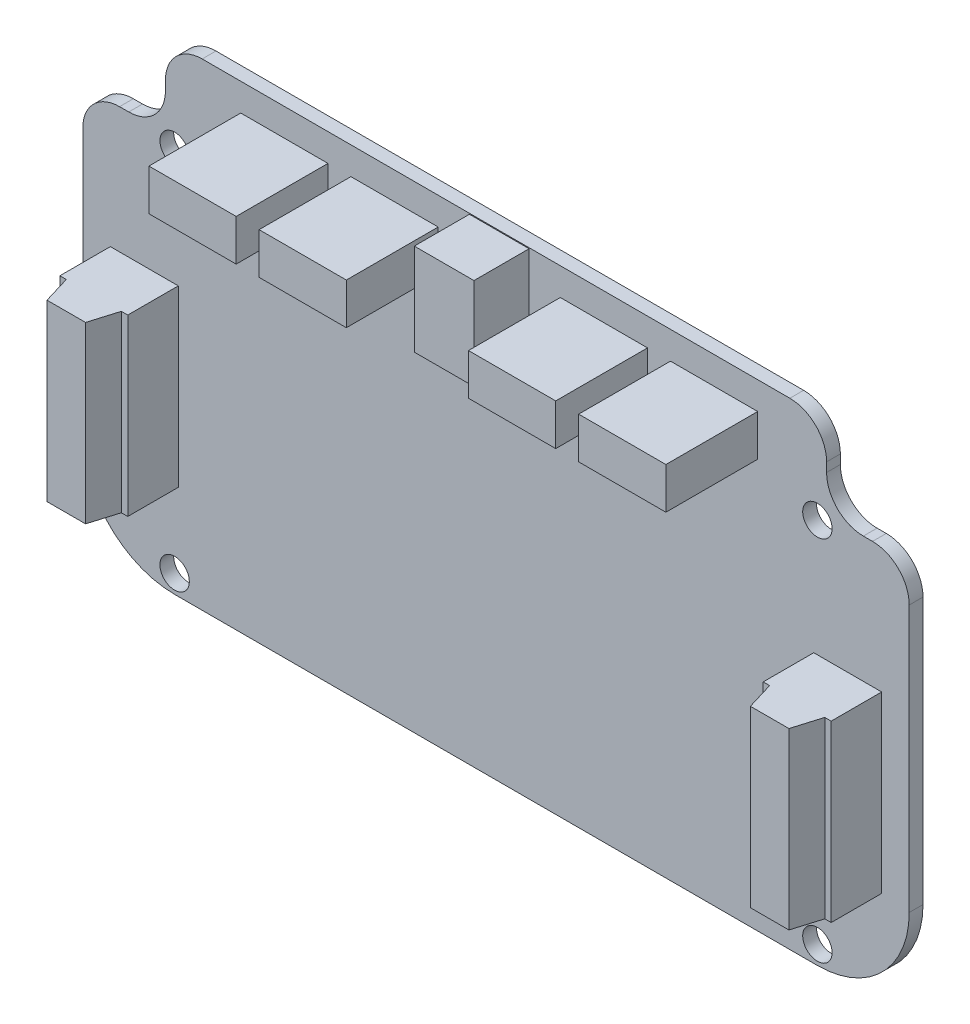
ISO-10303-21;
HEADER;
FILE_DESCRIPTION(('STEP AP214'),'2;1');
FILE_NAME('part.step','',(''),(''),'','','');
FILE_SCHEMA(('AUTOMOTIVE_DESIGN { 1 0 10303 214 1 1 1 1 }'));
ENDSEC;
DATA;
#1=APPLICATION_CONTEXT('core data for automotive mechanical design processes');
#2=APPLICATION_PROTOCOL_DEFINITION('international standard','automotive_design',2000,#1);
#3=PRODUCT_CONTEXT('',#1,'mechanical');
#4=PRODUCT('Part','Part','',(#3));
#5=PRODUCT_RELATED_PRODUCT_CATEGORY('part','',(#4));
#6=PRODUCT_DEFINITION_FORMATION('','',#4);
#7=PRODUCT_DEFINITION_CONTEXT('part definition',#1,'design');
#8=PRODUCT_DEFINITION('design','',#6,#7);
#9=PRODUCT_DEFINITION_SHAPE('','',#8);
#10=(LENGTH_UNIT() NAMED_UNIT(*) SI_UNIT(.MILLI.,.METRE.));
#11=(NAMED_UNIT(*) PLANE_ANGLE_UNIT() SI_UNIT($,.RADIAN.));
#12=(NAMED_UNIT(*) SI_UNIT($,.STERADIAN.) SOLID_ANGLE_UNIT());
#13=UNCERTAINTY_MEASURE_WITH_UNIT(LENGTH_MEASURE(1.E-05),#10,'distance_accuracy_value','');
#14=(GEOMETRIC_REPRESENTATION_CONTEXT(3) GLOBAL_UNCERTAINTY_ASSIGNED_CONTEXT((#13)) GLOBAL_UNIT_ASSIGNED_CONTEXT((#10,
#11,#12)) REPRESENTATION_CONTEXT('',''));
#15=CARTESIAN_POINT('',(0.,0.,0.));
#16=DIRECTION('',(0.,0.,1.));
#17=DIRECTION('',(1.,0.,0.));
#18=AXIS2_PLACEMENT_3D('',#15,#16,#17);
#19=CARTESIAN_POINT('',(-4.,39.,1.5));
#20=DIRECTION('',(0.,0.,1.));
#21=DIRECTION('',(1.,0.,0.));
#22=AXIS2_PLACEMENT_3D('',#19,#20,#21);
#23=PLANE('',#22);
#24=DIRECTION('',(1.,0.,0.));
#25=VECTOR('',#24,1.);
#26=CARTESIAN_POINT('',(-10.4,29.3,1.5));
#27=LINE('',#26,#25);
#28=CARTESIAN_POINT('',(-10.4,29.3,1.5));
#29=VERTEX_POINT('',#28);
#30=CARTESIAN_POINT('',(-3.,29.3,1.5));
#31=VERTEX_POINT('',#30);
#32=EDGE_CURVE('E366',#29,#31,#27,.T.);
#33=ORIENTED_EDGE('',*,*,#32,.T.);
#34=DIRECTION('',(0.,-1.,0.));
#35=VECTOR('',#34,1.);
#36=CARTESIAN_POINT('',(-3.,29.3,1.5));
#37=LINE('',#36,#35);
#38=CARTESIAN_POINT('',(-3.,10.3,1.5));
#39=VERTEX_POINT('',#38);
#40=EDGE_CURVE('E388',#31,#39,#37,.T.);
#41=ORIENTED_EDGE('',*,*,#40,.T.);
#42=DIRECTION('',(1.,0.,0.));
#43=VECTOR('',#42,1.);
#44=CARTESIAN_POINT('',(-10.4,10.3,1.5));
#45=LINE('',#44,#43);
#46=CARTESIAN_POINT('',(-10.4,10.3,1.5));
#47=VERTEX_POINT('',#46);
#48=EDGE_CURVE('E387',#47,#39,#45,.T.);
#49=ORIENTED_EDGE('',*,*,#48,.F.);
#50=DIRECTION('',(0.,-1.,0.));
#51=VECTOR('',#50,1.);
#52=CARTESIAN_POINT('',(-10.4,29.3,1.5));
#53=LINE('',#52,#51);
#54=EDGE_CURVE('E381',#29,#47,#53,.T.);
#55=ORIENTED_EDGE('',*,*,#54,.F.);
#56=EDGE_LOOP('',(#33,#41,#49,#55));
#57=FACE_BOUND('',#56,.T.);
#58=DIRECTION('',(1.,0.,0.));
#59=VECTOR('',#58,1.);
#60=CARTESIAN_POINT('',(-87.,29.3,1.5));
#61=LINE('',#60,#59);
#62=CARTESIAN_POINT('',(-87.,29.3,1.5));
#63=VERTEX_POINT('',#62);
#64=CARTESIAN_POINT('',(-79.6,29.3,1.5));
#65=VERTEX_POINT('',#64);
#66=EDGE_CURVE('E400',#63,#65,#61,.T.);
#67=ORIENTED_EDGE('',*,*,#66,.T.);
#68=DIRECTION('',(0.,-1.,0.));
#69=VECTOR('',#68,1.);
#70=CARTESIAN_POINT('',(-79.6,29.3,1.5));
#71=LINE('',#70,#69);
#72=CARTESIAN_POINT('',(-79.6,10.3,1.5));
#73=VERTEX_POINT('',#72);
#74=EDGE_CURVE('E455',#65,#73,#71,.T.);
#75=ORIENTED_EDGE('',*,*,#74,.T.);
#76=DIRECTION('',(1.,0.,0.));
#77=VECTOR('',#76,1.);
#78=CARTESIAN_POINT('',(-87.,10.3,1.5));
#79=LINE('',#78,#77);
#80=CARTESIAN_POINT('',(-87.,10.3,1.5));
#81=VERTEX_POINT('',#80);
#82=EDGE_CURVE('E424',#81,#73,#79,.T.);
#83=ORIENTED_EDGE('',*,*,#82,.F.);
#84=DIRECTION('',(0.,-1.,0.));
#85=VECTOR('',#84,1.);
#86=CARTESIAN_POINT('',(-87.,29.3,1.5));
#87=LINE('',#86,#85);
#88=EDGE_CURVE('E422',#63,#81,#87,.T.);
#89=ORIENTED_EDGE('',*,*,#88,.F.);
#90=EDGE_LOOP('',(#67,#75,#83,#89));
#91=FACE_BOUND('',#90,.T.);
#92=CARTESIAN_POINT('',(-80.,42.,1.5));
#93=DIRECTION('',(0.,0.,1.));
#94=DIRECTION('',(1.,0.,0.));
#95=AXIS2_PLACEMENT_3D('',#92,#93,#94);
#96=CIRCLE('',#95,1.59999999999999);
#97=CARTESIAN_POINT('',(-78.4,42.,1.5));
#98=VERTEX_POINT('',#97);
#99=EDGE_CURVE('E603',#98,#98,#96,.T.);
#100=ORIENTED_EDGE('',*,*,#99,.F.);
#101=EDGE_LOOP('',(#100));
#102=FACE_BOUND('',#101,.T.);
#103=CARTESIAN_POINT('',(-9.99999999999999,42.,1.5));
#104=DIRECTION('',(0.,0.,1.));
#105=DIRECTION('',(1.,0.,0.));
#106=AXIS2_PLACEMENT_3D('',#103,#104,#105);
#107=CIRCLE('',#106,1.59999999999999);
#108=CARTESIAN_POINT('',(-8.40000000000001,42.,1.5));
#109=VERTEX_POINT('',#108);
#110=EDGE_CURVE('E609',#109,#109,#107,.T.);
#111=ORIENTED_EDGE('',*,*,#110,.F.);
#112=EDGE_LOOP('',(#111));
#113=FACE_BOUND('',#112,.T.);
#114=CARTESIAN_POINT('',(-9.99999999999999,1.99999999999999,1.5));
#115=DIRECTION('',(0.,0.,1.));
#116=DIRECTION('',(1.,0.,0.));
#117=AXIS2_PLACEMENT_3D('',#114,#115,#116);
#118=CIRCLE('',#117,1.59999999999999);
#119=CARTESIAN_POINT('',(-8.40000000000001,1.99999999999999,1.5));
#120=VERTEX_POINT('',#119);
#121=EDGE_CURVE('E615',#120,#120,#118,.T.);
#122=ORIENTED_EDGE('',*,*,#121,.F.);
#123=EDGE_LOOP('',(#122));
#124=FACE_BOUND('',#123,.T.);
#125=CARTESIAN_POINT('',(-80.,1.99999999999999,1.5));
#126=DIRECTION('',(0.,0.,1.));
#127=DIRECTION('',(1.,0.,0.));
#128=AXIS2_PLACEMENT_3D('',#125,#126,#127);
#129=CIRCLE('',#128,1.59999999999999);
#130=CARTESIAN_POINT('',(-78.4,1.99999999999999,1.5));
#131=VERTEX_POINT('',#130);
#132=EDGE_CURVE('E621',#131,#131,#129,.T.);
#133=ORIENTED_EDGE('',*,*,#132,.F.);
#134=EDGE_LOOP('',(#133));
#135=FACE_BOUND('',#134,.T.);
#136=CARTESIAN_POINT('',(-4.,39.,1.5));
#137=DIRECTION('',(0.,0.,1.));
#138=DIRECTION('',(1.,0.,0.));
#139=AXIS2_PLACEMENT_3D('',#136,#137,#138);
#140=CIRCLE('',#139,4.);
#141=CARTESIAN_POINT('',(0.,39.,1.5));
#142=VERTEX_POINT('',#141);
#143=CARTESIAN_POINT('',(-4.00000000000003,43.,1.5));
#144=VERTEX_POINT('',#143);
#145=EDGE_CURVE('E628',#142,#144,#140,.T.);
#146=ORIENTED_EDGE('',*,*,#145,.T.);
#147=DIRECTION('',(-1.,0.,0.));
#148=VECTOR('',#147,1.);
#149=CARTESIAN_POINT('',(-4.99999999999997,43.,1.5));
#150=LINE('',#149,#148);
#151=CARTESIAN_POINT('',(-4.99999999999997,43.,1.5));
#152=VERTEX_POINT('',#151);
#153=EDGE_CURVE('E631',#144,#152,#150,.T.);
#154=ORIENTED_EDGE('',*,*,#153,.T.);
#155=CARTESIAN_POINT('',(-5.,47.,1.5));
#156=DIRECTION('',(0.,0.,-1.));
#157=DIRECTION('',(-1.,0.,0.));
#158=AXIS2_PLACEMENT_3D('',#155,#156,#157);
#159=CIRCLE('',#158,4.);
#160=CARTESIAN_POINT('',(-9.,47.,1.5));
#161=VERTEX_POINT('',#160);
#162=EDGE_CURVE('E634',#152,#161,#159,.T.);
#163=ORIENTED_EDGE('',*,*,#162,.T.);
#164=DIRECTION('',(0.,1.,0.));
#165=VECTOR('',#164,1.);
#166=CARTESIAN_POINT('',(-9.,48.,1.5));
#167=LINE('',#166,#165);
#168=CARTESIAN_POINT('',(-9.,48.,1.5));
#169=VERTEX_POINT('',#168);
#170=EDGE_CURVE('E636',#161,#169,#167,.T.);
#171=ORIENTED_EDGE('',*,*,#170,.T.);
#172=CARTESIAN_POINT('',(-13.,48.,1.5));
#173=DIRECTION('',(0.,0.,1.));
#174=DIRECTION('',(1.,0.,0.));
#175=AXIS2_PLACEMENT_3D('',#172,#173,#174);
#176=CIRCLE('',#175,4.);
#177=CARTESIAN_POINT('',(-13.,52.,1.5));
#178=VERTEX_POINT('',#177);
#179=EDGE_CURVE('E638',#169,#178,#176,.T.);
#180=ORIENTED_EDGE('',*,*,#179,.T.);
#181=DIRECTION('',(-1.,0.,0.));
#182=VECTOR('',#181,1.);
#183=CARTESIAN_POINT('',(-13.,52.,1.5));
#184=LINE('',#183,#182);
#185=CARTESIAN_POINT('',(-77.,52.,1.5));
#186=VERTEX_POINT('',#185);
#187=EDGE_CURVE('E640',#178,#186,#184,.T.);
#188=ORIENTED_EDGE('',*,*,#187,.T.);
#189=CARTESIAN_POINT('',(-77.,48.,1.5));
#190=DIRECTION('',(0.,0.,1.));
#191=DIRECTION('',(1.,0.,0.));
#192=AXIS2_PLACEMENT_3D('',#189,#190,#191);
#193=CIRCLE('',#192,4.);
#194=CARTESIAN_POINT('',(-81.,48.,1.5));
#195=VERTEX_POINT('',#194);
#196=EDGE_CURVE('E642',#186,#195,#193,.T.);
#197=ORIENTED_EDGE('',*,*,#196,.T.);
#198=DIRECTION('',(0.,-1.,0.));
#199=VECTOR('',#198,1.);
#200=CARTESIAN_POINT('',(-81.,48.,1.5));
#201=LINE('',#200,#199);
#202=CARTESIAN_POINT('',(-81.,47.,1.5));
#203=VERTEX_POINT('',#202);
#204=EDGE_CURVE('E644',#195,#203,#201,.T.);
#205=ORIENTED_EDGE('',*,*,#204,.T.);
#206=CARTESIAN_POINT('',(-85.,47.,1.5));
#207=DIRECTION('',(0.,0.,-1.));
#208=DIRECTION('',(-1.,0.,0.));
#209=AXIS2_PLACEMENT_3D('',#206,#207,#208);
#210=CIRCLE('',#209,4.);
#211=CARTESIAN_POINT('',(-85.,43.,1.5));
#212=VERTEX_POINT('',#211);
#213=EDGE_CURVE('E646',#203,#212,#210,.T.);
#214=ORIENTED_EDGE('',*,*,#213,.T.);
#215=DIRECTION('',(-1.,0.,0.));
#216=VECTOR('',#215,1.);
#217=CARTESIAN_POINT('',(-85.,43.,1.5));
#218=LINE('',#217,#216);
#219=CARTESIAN_POINT('',(-86.,43.,1.5));
#220=VERTEX_POINT('',#219);
#221=EDGE_CURVE('E648',#212,#220,#218,.T.);
#222=ORIENTED_EDGE('',*,*,#221,.T.);
#223=CARTESIAN_POINT('',(-86.,39.,1.5));
#224=DIRECTION('',(0.,0.,1.));
#225=DIRECTION('',(1.,0.,0.));
#226=AXIS2_PLACEMENT_3D('',#223,#224,#225);
#227=CIRCLE('',#226,4.);
#228=CARTESIAN_POINT('',(-90.,39.,1.5));
#229=VERTEX_POINT('',#228);
#230=EDGE_CURVE('E650',#220,#229,#227,.T.);
#231=ORIENTED_EDGE('',*,*,#230,.T.);
#232=DIRECTION('',(0.,-1.,0.));
#233=VECTOR('',#232,1.);
#234=CARTESIAN_POINT('',(-90.,10.0000000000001,1.5));
#235=LINE('',#234,#233);
#236=CARTESIAN_POINT('',(-90.,10.0000000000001,1.5));
#237=VERTEX_POINT('',#236);
#238=EDGE_CURVE('E652',#229,#237,#235,.T.);
#239=ORIENTED_EDGE('',*,*,#238,.T.);
#240=CARTESIAN_POINT('',(-80.,9.99999999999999,1.5));
#241=DIRECTION('',(0.,0.,1.));
#242=DIRECTION('',(-1.,0.,0.));
#243=AXIS2_PLACEMENT_3D('',#240,#241,#242);
#244=CIRCLE('',#243,10.);
#245=CARTESIAN_POINT('',(-79.9999999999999,0.,1.5));
#246=VERTEX_POINT('',#245);
#247=EDGE_CURVE('E654',#237,#246,#244,.T.);
#248=ORIENTED_EDGE('',*,*,#247,.T.);
#249=DIRECTION('',(1.,0.,0.));
#250=VECTOR('',#249,1.);
#251=CARTESIAN_POINT('',(-10.0000000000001,0.,1.5));
#252=LINE('',#251,#250);
#253=CARTESIAN_POINT('',(-10.0000000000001,0.,1.5));
#254=VERTEX_POINT('',#253);
#255=EDGE_CURVE('E656',#246,#254,#252,.T.);
#256=ORIENTED_EDGE('',*,*,#255,.T.);
#257=CARTESIAN_POINT('',(-10.,10.,1.5));
#258=DIRECTION('',(0.,0.,1.));
#259=DIRECTION('',(1.,0.,0.));
#260=AXIS2_PLACEMENT_3D('',#257,#258,#259);
#261=CIRCLE('',#260,10.);
#262=CARTESIAN_POINT('',(0.,10.0000000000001,1.5));
#263=VERTEX_POINT('',#262);
#264=EDGE_CURVE('E658',#254,#263,#261,.T.);
#265=ORIENTED_EDGE('',*,*,#264,.T.);
#266=DIRECTION('',(0.,1.,0.));
#267=VECTOR('',#266,1.);
#268=CARTESIAN_POINT('',(0.,10.0000000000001,1.5));
#269=LINE('',#268,#267);
#270=EDGE_CURVE('E660',#263,#142,#269,.T.);
#271=ORIENTED_EDGE('',*,*,#270,.T.);
#272=EDGE_LOOP('',(#146,#154,#163,#171,#180,#188,#197,#205,#214,#222,#231,#239,#248,#256,#265,#271));
#273=FACE_BOUND('',#272,.T.);
#274=DIRECTION('',(1.,0.,0.));
#275=VECTOR('',#274,1.);
#276=CARTESIAN_POINT('',(-72.8,44.5,1.5));
#277=LINE('',#276,#275);
#278=CARTESIAN_POINT('',(-72.8,44.5,1.5));
#279=VERTEX_POINT('',#278);
#280=CARTESIAN_POINT('',(-63.3,44.5,1.5));
#281=VERTEX_POINT('',#280);
#282=EDGE_CURVE('E588',#279,#281,#277,.T.);
#283=ORIENTED_EDGE('',*,*,#282,.F.);
#284=DIRECTION('',(0.,-1.,0.));
#285=VECTOR('',#284,1.);
#286=CARTESIAN_POINT('',(-72.8,49.,1.5));
#287=LINE('',#286,#285);
#288=CARTESIAN_POINT('',(-72.8,49.,1.5));
#289=VERTEX_POINT('',#288);
#290=EDGE_CURVE('E574',#289,#279,#287,.T.);
#291=ORIENTED_EDGE('',*,*,#290,.F.);
#292=DIRECTION('',(-1.,0.,0.));
#293=VECTOR('',#292,1.);
#294=CARTESIAN_POINT('',(-72.8,49.,1.5));
#295=LINE('',#294,#293);
#296=CARTESIAN_POINT('',(-63.3,49.,1.5));
#297=VERTEX_POINT('',#296);
#298=EDGE_CURVE('E579',#297,#289,#295,.T.);
#299=ORIENTED_EDGE('',*,*,#298,.F.);
#300=DIRECTION('',(0.,1.,0.));
#301=VECTOR('',#300,1.);
#302=CARTESIAN_POINT('',(-63.3,49.,1.5));
#303=LINE('',#302,#301);
#304=EDGE_CURVE('E590',#281,#297,#303,.T.);
#305=ORIENTED_EDGE('',*,*,#304,.F.);
#306=EDGE_LOOP('',(#283,#291,#299,#305));
#307=FACE_BOUND('',#306,.T.);
#308=DIRECTION('',(0.,1.,0.));
#309=VECTOR('',#308,1.);
#310=CARTESIAN_POINT('',(-16.5,49.,1.5));
#311=LINE('',#310,#309);
#312=CARTESIAN_POINT('',(-16.5,44.5,1.5));
#313=VERTEX_POINT('',#312);
#314=CARTESIAN_POINT('',(-16.5,49.,1.5));
#315=VERTEX_POINT('',#314);
#316=EDGE_CURVE('E559',#313,#315,#311,.T.);
#317=ORIENTED_EDGE('',*,*,#316,.F.);
#318=DIRECTION('',(1.,0.,0.));
#319=VECTOR('',#318,1.);
#320=CARTESIAN_POINT('',(-26.,44.5,1.5));
#321=LINE('',#320,#319);
#322=CARTESIAN_POINT('',(-26.,44.5,1.5));
#323=VERTEX_POINT('',#322);
#324=EDGE_CURVE('E545',#323,#313,#321,.T.);
#325=ORIENTED_EDGE('',*,*,#324,.F.);
#326=DIRECTION('',(0.,-1.,0.));
#327=VECTOR('',#326,1.);
#328=CARTESIAN_POINT('',(-26.,49.,1.5));
#329=LINE('',#328,#327);
#330=CARTESIAN_POINT('',(-26.,49.,1.5));
#331=VERTEX_POINT('',#330);
#332=EDGE_CURVE('E550',#331,#323,#329,.T.);
#333=ORIENTED_EDGE('',*,*,#332,.F.);
#334=DIRECTION('',(-1.,0.,0.));
#335=VECTOR('',#334,1.);
#336=CARTESIAN_POINT('',(-26.,49.,1.5));
#337=LINE('',#336,#335);
#338=EDGE_CURVE('E561',#315,#331,#337,.T.);
#339=ORIENTED_EDGE('',*,*,#338,.F.);
#340=EDGE_LOOP('',(#317,#325,#333,#339));
#341=FACE_BOUND('',#340,.T.);
#342=DIRECTION('',(0.,-1.,0.));
#343=VECTOR('',#342,1.);
#344=CARTESIAN_POINT('',(-60.8,49.,1.5));
#345=LINE('',#344,#343);
#346=CARTESIAN_POINT('',(-60.8,49.,1.5));
#347=VERTEX_POINT('',#346);
#348=CARTESIAN_POINT('',(-60.8,44.5,1.5));
#349=VERTEX_POINT('',#348);
#350=EDGE_CURVE('E530',#347,#349,#345,.T.);
#351=ORIENTED_EDGE('',*,*,#350,.F.);
#352=DIRECTION('',(-1.,0.,0.));
#353=VECTOR('',#352,1.);
#354=CARTESIAN_POINT('',(-60.8,49.,1.5));
#355=LINE('',#354,#353);
#356=CARTESIAN_POINT('',(-51.3,49.,1.5));
#357=VERTEX_POINT('',#356);
#358=EDGE_CURVE('E516',#357,#347,#355,.T.);
#359=ORIENTED_EDGE('',*,*,#358,.F.);
#360=DIRECTION('',(0.,1.,0.));
#361=VECTOR('',#360,1.);
#362=CARTESIAN_POINT('',(-51.3,49.,1.5));
#363=LINE('',#362,#361);
#364=CARTESIAN_POINT('',(-51.3,44.5,1.5));
#365=VERTEX_POINT('',#364);
#366=EDGE_CURVE('E521',#365,#357,#363,.T.);
#367=ORIENTED_EDGE('',*,*,#366,.F.);
#368=DIRECTION('',(1.,0.,0.));
#369=VECTOR('',#368,1.);
#370=CARTESIAN_POINT('',(-60.8,44.5,1.5));
#371=LINE('',#370,#369);
#372=EDGE_CURVE('E532',#349,#365,#371,.T.);
#373=ORIENTED_EDGE('',*,*,#372,.F.);
#374=EDGE_LOOP('',(#351,#359,#367,#373));
#375=FACE_BOUND('',#374,.T.);
#376=DIRECTION('',(0.,-1.,0.));
#377=VECTOR('',#376,1.);
#378=CARTESIAN_POINT('',(-38.,49.,1.5));
#379=LINE('',#378,#377);
#380=CARTESIAN_POINT('',(-38.,49.,1.5));
#381=VERTEX_POINT('',#380);
#382=CARTESIAN_POINT('',(-38.,44.5,1.5));
#383=VERTEX_POINT('',#382);
#384=EDGE_CURVE('E501',#381,#383,#379,.T.);
#385=ORIENTED_EDGE('',*,*,#384,.F.);
#386=DIRECTION('',(-1.,0.,0.));
#387=VECTOR('',#386,1.);
#388=CARTESIAN_POINT('',(-38.,49.,1.5));
#389=LINE('',#388,#387);
#390=CARTESIAN_POINT('',(-28.5,49.,1.5));
#391=VERTEX_POINT('',#390);
#392=EDGE_CURVE('E487',#391,#381,#389,.T.);
#393=ORIENTED_EDGE('',*,*,#392,.F.);
#394=DIRECTION('',(0.,1.,0.));
#395=VECTOR('',#394,1.);
#396=CARTESIAN_POINT('',(-28.5,49.,1.5));
#397=LINE('',#396,#395);
#398=CARTESIAN_POINT('',(-28.5,44.5,1.5));
#399=VERTEX_POINT('',#398);
#400=EDGE_CURVE('E492',#399,#391,#397,.T.);
#401=ORIENTED_EDGE('',*,*,#400,.F.);
#402=DIRECTION('',(1.,0.,0.));
#403=VECTOR('',#402,1.);
#404=CARTESIAN_POINT('',(-38.,44.5,1.5));
#405=LINE('',#404,#403);
#406=EDGE_CURVE('E503',#383,#399,#405,.T.);
#407=ORIENTED_EDGE('',*,*,#406,.F.);
#408=EDGE_LOOP('',(#385,#393,#401,#407));
#409=FACE_BOUND('',#408,.T.);
#410=DIRECTION('',(1.,0.,0.));
#411=VECTOR('',#410,1.);
#412=CARTESIAN_POINT('',(-47.9,41.9,1.5));
#413=LINE('',#412,#411);
#414=CARTESIAN_POINT('',(-47.9,41.9,1.5));
#415=VERTEX_POINT('',#414);
#416=CARTESIAN_POINT('',(-41.4,41.9,1.5));
#417=VERTEX_POINT('',#416);
#418=EDGE_CURVE('E472',#415,#417,#413,.T.);
#419=ORIENTED_EDGE('',*,*,#418,.F.);
#420=DIRECTION('',(0.,-1.,0.));
#421=VECTOR('',#420,1.);
#422=CARTESIAN_POINT('',(-47.9,51.9,1.5));
#423=LINE('',#422,#421);
#424=CARTESIAN_POINT('',(-47.9,51.9,1.5));
#425=VERTEX_POINT('',#424);
#426=EDGE_CURVE('E444',#425,#415,#423,.T.);
#427=ORIENTED_EDGE('',*,*,#426,.F.);
#428=DIRECTION('',(-1.,0.,0.));
#429=VECTOR('',#428,1.);
#430=CARTESIAN_POINT('',(-47.9,51.9,1.5));
#431=LINE('',#430,#429);
#432=CARTESIAN_POINT('',(-41.4,51.9,1.5));
#433=VERTEX_POINT('',#432);
#434=EDGE_CURVE('E463',#433,#425,#431,.T.);
#435=ORIENTED_EDGE('',*,*,#434,.F.);
#436=DIRECTION('',(0.,1.,0.));
#437=VECTOR('',#436,1.);
#438=CARTESIAN_POINT('',(-41.4,51.9,1.5));
#439=LINE('',#438,#437);
#440=EDGE_CURVE('E474',#417,#433,#439,.T.);
#441=ORIENTED_EDGE('',*,*,#440,.F.);
#442=EDGE_LOOP('',(#419,#427,#435,#441));
#443=FACE_BOUND('',#442,.T.);
#444=ADVANCED_FACE('F32',(#57,#91,#102,#113,#124,#135,#273,#307,#341,#375,#409,#443),#23,.T.);
#445=CARTESIAN_POINT('',(-4.,39.,1.5));
#446=DIRECTION('',(0.,0.,-1.));
#447=DIRECTION('',(-1.,0.,0.));
#448=AXIS2_PLACEMENT_3D('',#445,#446,#447);
#449=CYLINDRICAL_SURFACE('',#448,4.);
#450=CARTESIAN_POINT('',(-4.,39.,0.));
#451=DIRECTION('',(0.,0.,1.));
#452=DIRECTION('',(1.,0.,0.));
#453=AXIS2_PLACEMENT_3D('',#450,#451,#452);
#454=CIRCLE('',#453,4.);
#455=CARTESIAN_POINT('',(0.,39.,0.));
#456=VERTEX_POINT('',#455);
#457=CARTESIAN_POINT('',(-4.00000000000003,43.,0.));
#458=VERTEX_POINT('',#457);
#459=EDGE_CURVE('E627',#456,#458,#454,.T.);
#460=ORIENTED_EDGE('',*,*,#459,.T.);
#461=DIRECTION('',(0.,0.,-1.));
#462=VECTOR('',#461,1.);
#463=CARTESIAN_POINT('',(-4.00000000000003,43.,1.5));
#464=LINE('',#463,#462);
#465=EDGE_CURVE('E11',#144,#458,#464,.T.);
#466=ORIENTED_EDGE('',*,*,#465,.F.);
#467=ORIENTED_EDGE('',*,*,#145,.F.);
#468=DIRECTION('',(0.,0.,-1.));
#469=VECTOR('',#468,1.);
#470=CARTESIAN_POINT('',(0.,39.,1.5));
#471=LINE('',#470,#469);
#472=EDGE_CURVE('E662',#142,#456,#471,.T.);
#473=ORIENTED_EDGE('',*,*,#472,.T.);
#474=EDGE_LOOP('',(#460,#466,#467,#473));
#475=FACE_BOUND('',#474,.T.);
#476=ADVANCED_FACE('F34',(#475),#449,.T.);
#477=CARTESIAN_POINT('',(-4.99999999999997,43.,1.5));
#478=DIRECTION('',(0.,-1.,0.));
#479=DIRECTION('',(0.,0.,-1.));
#480=AXIS2_PLACEMENT_3D('',#477,#478,#479);
#481=PLANE('',#480);
#482=DIRECTION('',(-1.,0.,0.));
#483=VECTOR('',#482,1.);
#484=CARTESIAN_POINT('',(-4.99999999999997,43.,0.));
#485=LINE('',#484,#483);
#486=CARTESIAN_POINT('',(-4.99999999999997,43.,0.));
#487=VERTEX_POINT('',#486);
#488=EDGE_CURVE('E665',#458,#487,#485,.T.);
#489=ORIENTED_EDGE('',*,*,#488,.T.);
#490=DIRECTION('',(0.,0.,-1.));
#491=VECTOR('',#490,1.);
#492=CARTESIAN_POINT('',(-4.99999999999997,43.,1.5));
#493=LINE('',#492,#491);
#494=EDGE_CURVE('E40',#152,#487,#493,.T.);
#495=ORIENTED_EDGE('',*,*,#494,.F.);
#496=ORIENTED_EDGE('',*,*,#153,.F.);
#497=ORIENTED_EDGE('',*,*,#465,.T.);
#498=EDGE_LOOP('',(#489,#495,#496,#497));
#499=FACE_BOUND('',#498,.T.);
#500=ADVANCED_FACE('F762',(#499),#481,.F.);
#501=CARTESIAN_POINT('',(-5.,47.,1.5));
#502=DIRECTION('',(0.,0.,-1.));
#503=DIRECTION('',(-1.,0.,0.));
#504=AXIS2_PLACEMENT_3D('',#501,#502,#503);
#505=CYLINDRICAL_SURFACE('',#504,4.);
#506=CARTESIAN_POINT('',(-5.,47.,0.));
#507=DIRECTION('',(0.,0.,-1.));
#508=DIRECTION('',(-1.,0.,0.));
#509=AXIS2_PLACEMENT_3D('',#506,#507,#508);
#510=CIRCLE('',#509,4.);
#511=CARTESIAN_POINT('',(-9.,47.,0.));
#512=VERTEX_POINT('',#511);
#513=EDGE_CURVE('E667',#487,#512,#510,.T.);
#514=ORIENTED_EDGE('',*,*,#513,.T.);
#515=DIRECTION('',(0.,0.,-1.));
#516=VECTOR('',#515,1.);
#517=CARTESIAN_POINT('',(-9.,47.,1.5));
#518=LINE('',#517,#516);
#519=EDGE_CURVE('E732',#161,#512,#518,.T.);
#520=ORIENTED_EDGE('',*,*,#519,.F.);
#521=ORIENTED_EDGE('',*,*,#162,.F.);
#522=ORIENTED_EDGE('',*,*,#494,.T.);
#523=EDGE_LOOP('',(#514,#520,#521,#522));
#524=FACE_BOUND('',#523,.T.);
#525=ADVANCED_FACE('F739',(#524),#505,.F.);
#526=CARTESIAN_POINT('',(-9.,48.,1.5));
#527=DIRECTION('',(-1.,0.,0.));
#528=DIRECTION('',(0.,0.,1.));
#529=AXIS2_PLACEMENT_3D('',#526,#527,#528);
#530=PLANE('',#529);
#531=DIRECTION('',(0.,1.,0.));
#532=VECTOR('',#531,1.);
#533=CARTESIAN_POINT('',(-9.,48.,0.));
#534=LINE('',#533,#532);
#535=CARTESIAN_POINT('',(-9.,48.,0.));
#536=VERTEX_POINT('',#535);
#537=EDGE_CURVE('E669',#512,#536,#534,.T.);
#538=ORIENTED_EDGE('',*,*,#537,.T.);
#539=DIRECTION('',(0.,0.,-1.));
#540=VECTOR('',#539,1.);
#541=CARTESIAN_POINT('',(-9.,48.,1.5));
#542=LINE('',#541,#540);
#543=EDGE_CURVE('E729',#169,#536,#542,.T.);
#544=ORIENTED_EDGE('',*,*,#543,.F.);
#545=ORIENTED_EDGE('',*,*,#170,.F.);
#546=ORIENTED_EDGE('',*,*,#519,.T.);
#547=EDGE_LOOP('',(#538,#544,#545,#546));
#548=FACE_BOUND('',#547,.T.);
#549=ADVANCED_FACE('F750',(#548),#530,.F.);
#550=CARTESIAN_POINT('',(-13.,48.,1.5));
#551=DIRECTION('',(0.,0.,-1.));
#552=DIRECTION('',(-1.,0.,0.));
#553=AXIS2_PLACEMENT_3D('',#550,#551,#552);
#554=CYLINDRICAL_SURFACE('',#553,4.);
#555=CARTESIAN_POINT('',(-13.,48.,0.));
#556=DIRECTION('',(0.,0.,1.));
#557=DIRECTION('',(1.,0.,0.));
#558=AXIS2_PLACEMENT_3D('',#555,#556,#557);
#559=CIRCLE('',#558,4.);
#560=CARTESIAN_POINT('',(-13.,52.,0.));
#561=VERTEX_POINT('',#560);
#562=EDGE_CURVE('E671',#536,#561,#559,.T.);
#563=ORIENTED_EDGE('',*,*,#562,.T.);
#564=DIRECTION('',(0.,0.,-1.));
#565=VECTOR('',#564,1.);
#566=CARTESIAN_POINT('',(-13.,52.,1.5));
#567=LINE('',#566,#565);
#568=EDGE_CURVE('E726',#178,#561,#567,.T.);
#569=ORIENTED_EDGE('',*,*,#568,.F.);
#570=ORIENTED_EDGE('',*,*,#179,.F.);
#571=ORIENTED_EDGE('',*,*,#543,.T.);
#572=EDGE_LOOP('',(#563,#569,#570,#571));
#573=FACE_BOUND('',#572,.T.);
#574=ADVANCED_FACE('F754',(#573),#554,.T.);
#575=CARTESIAN_POINT('',(-13.,52.,1.5));
#576=DIRECTION('',(0.,-1.,0.));
#577=DIRECTION('',(1.,0.,0.));
#578=AXIS2_PLACEMENT_3D('',#575,#576,#577);
#579=PLANE('',#578);
#580=DIRECTION('',(-1.,0.,0.));
#581=VECTOR('',#580,1.);
#582=CARTESIAN_POINT('',(-13.,52.,0.));
#583=LINE('',#582,#581);
#584=CARTESIAN_POINT('',(-77.,52.,0.));
#585=VERTEX_POINT('',#584);
#586=EDGE_CURVE('E673',#561,#585,#583,.T.);
#587=ORIENTED_EDGE('',*,*,#586,.T.);
#588=DIRECTION('',(0.,0.,-1.));
#589=VECTOR('',#588,1.);
#590=CARTESIAN_POINT('',(-77.,52.,1.5));
#591=LINE('',#590,#589);
#592=EDGE_CURVE('E723',#186,#585,#591,.T.);
#593=ORIENTED_EDGE('',*,*,#592,.F.);
#594=ORIENTED_EDGE('',*,*,#187,.F.);
#595=ORIENTED_EDGE('',*,*,#568,.T.);
#596=EDGE_LOOP('',(#587,#593,#594,#595));
#597=FACE_BOUND('',#596,.T.);
#598=ADVANCED_FACE('F815',(#597),#579,.F.);
#599=CARTESIAN_POINT('',(-77.,48.,1.5));
#600=DIRECTION('',(0.,0.,-1.));
#601=DIRECTION('',(-1.,0.,0.));
#602=AXIS2_PLACEMENT_3D('',#599,#600,#601);
#603=CYLINDRICAL_SURFACE('',#602,4.);
#604=CARTESIAN_POINT('',(-77.,48.,0.));
#605=DIRECTION('',(0.,0.,1.));
#606=DIRECTION('',(1.,0.,0.));
#607=AXIS2_PLACEMENT_3D('',#604,#605,#606);
#608=CIRCLE('',#607,4.);
#609=CARTESIAN_POINT('',(-81.,48.,0.));
#610=VERTEX_POINT('',#609);
#611=EDGE_CURVE('E675',#585,#610,#608,.T.);
#612=ORIENTED_EDGE('',*,*,#611,.T.);
#613=DIRECTION('',(0.,0.,-1.));
#614=VECTOR('',#613,1.);
#615=CARTESIAN_POINT('',(-81.,48.,1.5));
#616=LINE('',#615,#614);
#617=EDGE_CURVE('E720',#195,#610,#616,.T.);
#618=ORIENTED_EDGE('',*,*,#617,.F.);
#619=ORIENTED_EDGE('',*,*,#196,.F.);
#620=ORIENTED_EDGE('',*,*,#592,.T.);
#621=EDGE_LOOP('',(#612,#618,#619,#620));
#622=FACE_BOUND('',#621,.T.);
#623=ADVANCED_FACE('F812',(#622),#603,.T.);
#624=CARTESIAN_POINT('',(-81.,48.,1.5));
#625=DIRECTION('',(1.,0.,0.));
#626=DIRECTION('',(0.,0.,-1.));
#627=AXIS2_PLACEMENT_3D('',#624,#625,#626);
#628=PLANE('',#627);
#629=DIRECTION('',(0.,-1.,0.));
#630=VECTOR('',#629,1.);
#631=CARTESIAN_POINT('',(-81.,48.,0.));
#632=LINE('',#631,#630);
#633=CARTESIAN_POINT('',(-81.,47.,0.));
#634=VERTEX_POINT('',#633);
#635=EDGE_CURVE('E677',#610,#634,#632,.T.);
#636=ORIENTED_EDGE('',*,*,#635,.T.);
#637=DIRECTION('',(0.,0.,-1.));
#638=VECTOR('',#637,1.);
#639=CARTESIAN_POINT('',(-81.,47.,1.5));
#640=LINE('',#639,#638);
#641=EDGE_CURVE('E717',#203,#634,#640,.T.);
#642=ORIENTED_EDGE('',*,*,#641,.F.);
#643=ORIENTED_EDGE('',*,*,#204,.F.);
#644=ORIENTED_EDGE('',*,*,#617,.T.);
#645=EDGE_LOOP('',(#636,#642,#643,#644));
#646=FACE_BOUND('',#645,.T.);
#647=ADVANCED_FACE('F808',(#646),#628,.F.);
#648=CARTESIAN_POINT('',(-85.,47.,1.5));
#649=DIRECTION('',(0.,0.,-1.));
#650=DIRECTION('',(-1.,0.,0.));
#651=AXIS2_PLACEMENT_3D('',#648,#649,#650);
#652=CYLINDRICAL_SURFACE('',#651,4.);
#653=CARTESIAN_POINT('',(-85.,47.,0.));
#654=DIRECTION('',(0.,0.,-1.));
#655=DIRECTION('',(-1.,0.,0.));
#656=AXIS2_PLACEMENT_3D('',#653,#654,#655);
#657=CIRCLE('',#656,4.);
#658=CARTESIAN_POINT('',(-85.,43.,0.));
#659=VERTEX_POINT('',#658);
#660=EDGE_CURVE('E679',#634,#659,#657,.T.);
#661=ORIENTED_EDGE('',*,*,#660,.T.);
#662=DIRECTION('',(0.,0.,-1.));
#663=VECTOR('',#662,1.);
#664=CARTESIAN_POINT('',(-85.,43.,1.5));
#665=LINE('',#664,#663);
#666=EDGE_CURVE('E714',#212,#659,#665,.T.);
#667=ORIENTED_EDGE('',*,*,#666,.F.);
#668=ORIENTED_EDGE('',*,*,#213,.F.);
#669=ORIENTED_EDGE('',*,*,#641,.T.);
#670=EDGE_LOOP('',(#661,#667,#668,#669));
#671=FACE_BOUND('',#670,.T.);
#672=ADVANCED_FACE('F804',(#671),#652,.F.);
#673=CARTESIAN_POINT('',(-85.,43.,1.5));
#674=DIRECTION('',(0.,-1.,0.));
#675=DIRECTION('',(0.,0.,-1.));
#676=AXIS2_PLACEMENT_3D('',#673,#674,#675);
#677=PLANE('',#676);
#678=DIRECTION('',(-1.,0.,0.));
#679=VECTOR('',#678,1.);
#680=CARTESIAN_POINT('',(-85.,43.,0.));
#681=LINE('',#680,#679);
#682=CARTESIAN_POINT('',(-86.,43.,0.));
#683=VERTEX_POINT('',#682);
#684=EDGE_CURVE('E681',#659,#683,#681,.T.);
#685=ORIENTED_EDGE('',*,*,#684,.T.);
#686=DIRECTION('',(0.,0.,-1.));
#687=VECTOR('',#686,1.);
#688=CARTESIAN_POINT('',(-86.,43.,1.5));
#689=LINE('',#688,#687);
#690=EDGE_CURVE('E711',#220,#683,#689,.T.);
#691=ORIENTED_EDGE('',*,*,#690,.F.);
#692=ORIENTED_EDGE('',*,*,#221,.F.);
#693=ORIENTED_EDGE('',*,*,#666,.T.);
#694=EDGE_LOOP('',(#685,#691,#692,#693));
#695=FACE_BOUND('',#694,.T.);
#696=ADVANCED_FACE('F799',(#695),#677,.F.);
#697=CARTESIAN_POINT('',(-86.,39.,1.5));
#698=DIRECTION('',(0.,0.,-1.));
#699=DIRECTION('',(-1.,0.,0.));
#700=AXIS2_PLACEMENT_3D('',#697,#698,#699);
#701=CYLINDRICAL_SURFACE('',#700,4.);
#702=CARTESIAN_POINT('',(-86.,39.,0.));
#703=DIRECTION('',(0.,0.,1.));
#704=DIRECTION('',(1.,0.,0.));
#705=AXIS2_PLACEMENT_3D('',#702,#703,#704);
#706=CIRCLE('',#705,4.);
#707=CARTESIAN_POINT('',(-90.,39.,0.));
#708=VERTEX_POINT('',#707);
#709=EDGE_CURVE('E683',#683,#708,#706,.T.);
#710=ORIENTED_EDGE('',*,*,#709,.T.);
#711=DIRECTION('',(0.,0.,-1.));
#712=VECTOR('',#711,1.);
#713=CARTESIAN_POINT('',(-90.,39.,1.5));
#714=LINE('',#713,#712);
#715=EDGE_CURVE('E708',#229,#708,#714,.T.);
#716=ORIENTED_EDGE('',*,*,#715,.F.);
#717=ORIENTED_EDGE('',*,*,#230,.F.);
#718=ORIENTED_EDGE('',*,*,#690,.T.);
#719=EDGE_LOOP('',(#710,#716,#717,#718));
#720=FACE_BOUND('',#719,.T.);
#721=ADVANCED_FACE('F793',(#720),#701,.T.);
#722=CARTESIAN_POINT('',(-90.,10.0000000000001,1.5));
#723=DIRECTION('',(1.,0.,0.));
#724=DIRECTION('',(0.,0.,-1.));
#725=AXIS2_PLACEMENT_3D('',#722,#723,#724);
#726=PLANE('',#725);
#727=DIRECTION('',(0.,-1.,0.));
#728=VECTOR('',#727,1.);
#729=CARTESIAN_POINT('',(-90.,10.0000000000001,0.));
#730=LINE('',#729,#728);
#731=CARTESIAN_POINT('',(-90.,10.0000000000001,0.));
#732=VERTEX_POINT('',#731);
#733=EDGE_CURVE('E685',#708,#732,#730,.T.);
#734=ORIENTED_EDGE('',*,*,#733,.T.);
#735=DIRECTION('',(0.,0.,-1.));
#736=VECTOR('',#735,1.);
#737=CARTESIAN_POINT('',(-90.,10.0000000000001,1.5));
#738=LINE('',#737,#736);
#739=EDGE_CURVE('E705',#237,#732,#738,.T.);
#740=ORIENTED_EDGE('',*,*,#739,.F.);
#741=ORIENTED_EDGE('',*,*,#238,.F.);
#742=ORIENTED_EDGE('',*,*,#715,.T.);
#743=EDGE_LOOP('',(#734,#740,#741,#742));
#744=FACE_BOUND('',#743,.T.);
#745=ADVANCED_FACE('F789',(#744),#726,.F.);
#746=CARTESIAN_POINT('',(-80.,9.99999999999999,1.5));
#747=DIRECTION('',(0.,0.,-1.));
#748=DIRECTION('',(-1.,0.,0.));
#749=AXIS2_PLACEMENT_3D('',#746,#747,#748);
#750=CYLINDRICAL_SURFACE('',#749,10.);
#751=CARTESIAN_POINT('',(-80.,9.99999999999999,0.));
#752=DIRECTION('',(0.,0.,1.));
#753=DIRECTION('',(-1.,0.,0.));
#754=AXIS2_PLACEMENT_3D('',#751,#752,#753);
#755=CIRCLE('',#754,10.);
#756=CARTESIAN_POINT('',(-79.9999999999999,0.,0.));
#757=VERTEX_POINT('',#756);
#758=EDGE_CURVE('E687',#732,#757,#755,.T.);
#759=ORIENTED_EDGE('',*,*,#758,.T.);
#760=DIRECTION('',(0.,0.,-1.));
#761=VECTOR('',#760,1.);
#762=CARTESIAN_POINT('',(-79.9999999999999,0.,1.5));
#763=LINE('',#762,#761);
#764=EDGE_CURVE('E702',#246,#757,#763,.T.);
#765=ORIENTED_EDGE('',*,*,#764,.F.);
#766=ORIENTED_EDGE('',*,*,#247,.F.);
#767=ORIENTED_EDGE('',*,*,#739,.T.);
#768=EDGE_LOOP('',(#759,#765,#766,#767));
#769=FACE_BOUND('',#768,.T.);
#770=ADVANCED_FACE('F784',(#769),#750,.T.);
#771=CARTESIAN_POINT('',(-10.0000000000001,0.,1.5));
#772=DIRECTION('',(0.,1.,0.));
#773=DIRECTION('',(-1.,0.,0.));
#774=AXIS2_PLACEMENT_3D('',#771,#772,#773);
#775=PLANE('',#774);
#776=DIRECTION('',(1.,0.,0.));
#777=VECTOR('',#776,1.);
#778=CARTESIAN_POINT('',(-10.0000000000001,0.,0.));
#779=LINE('',#778,#777);
#780=CARTESIAN_POINT('',(-10.0000000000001,0.,0.));
#781=VERTEX_POINT('',#780);
#782=EDGE_CURVE('E689',#757,#781,#779,.T.);
#783=ORIENTED_EDGE('',*,*,#782,.T.);
#784=DIRECTION('',(0.,0.,-1.));
#785=VECTOR('',#784,1.);
#786=CARTESIAN_POINT('',(-10.0000000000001,0.,1.5));
#787=LINE('',#786,#785);
#788=EDGE_CURVE('E699',#254,#781,#787,.T.);
#789=ORIENTED_EDGE('',*,*,#788,.F.);
#790=ORIENTED_EDGE('',*,*,#255,.F.);
#791=ORIENTED_EDGE('',*,*,#764,.T.);
#792=EDGE_LOOP('',(#783,#789,#790,#791));
#793=FACE_BOUND('',#792,.T.);
#794=ADVANCED_FACE('F778',(#793),#775,.F.);
#795=CARTESIAN_POINT('',(-10.,10.,1.5));
#796=DIRECTION('',(0.,0.,-1.));
#797=DIRECTION('',(-1.,0.,0.));
#798=AXIS2_PLACEMENT_3D('',#795,#796,#797);
#799=CYLINDRICAL_SURFACE('',#798,10.);
#800=CARTESIAN_POINT('',(-10.,10.,0.));
#801=DIRECTION('',(0.,0.,1.));
#802=DIRECTION('',(1.,0.,0.));
#803=AXIS2_PLACEMENT_3D('',#800,#801,#802);
#804=CIRCLE('',#803,10.);
#805=CARTESIAN_POINT('',(0.,10.0000000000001,0.));
#806=VERTEX_POINT('',#805);
#807=EDGE_CURVE('E691',#781,#806,#804,.T.);
#808=ORIENTED_EDGE('',*,*,#807,.T.);
#809=DIRECTION('',(0.,0.,-1.));
#810=VECTOR('',#809,1.);
#811=CARTESIAN_POINT('',(0.,10.0000000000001,1.5));
#812=LINE('',#811,#810);
#813=EDGE_CURVE('E696',#263,#806,#812,.T.);
#814=ORIENTED_EDGE('',*,*,#813,.F.);
#815=ORIENTED_EDGE('',*,*,#264,.F.);
#816=ORIENTED_EDGE('',*,*,#788,.T.);
#817=EDGE_LOOP('',(#808,#814,#815,#816));
#818=FACE_BOUND('',#817,.T.);
#819=ADVANCED_FACE('F774',(#818),#799,.T.);
#820=CARTESIAN_POINT('',(0.,10.0000000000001,1.5));
#821=DIRECTION('',(-1.,0.,0.));
#822=DIRECTION('',(0.,-1.,0.));
#823=AXIS2_PLACEMENT_3D('',#820,#821,#822);
#824=PLANE('',#823);
#825=DIRECTION('',(0.,1.,0.));
#826=VECTOR('',#825,1.);
#827=CARTESIAN_POINT('',(0.,10.0000000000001,0.));
#828=LINE('',#827,#826);
#829=EDGE_CURVE('E632',#806,#456,#828,.T.);
#830=ORIENTED_EDGE('',*,*,#829,.T.);
#831=ORIENTED_EDGE('',*,*,#472,.F.);
#832=ORIENTED_EDGE('',*,*,#270,.F.);
#833=ORIENTED_EDGE('',*,*,#813,.T.);
#834=EDGE_LOOP('',(#830,#831,#832,#833));
#835=FACE_BOUND('',#834,.T.);
#836=ADVANCED_FACE('F769',(#835),#824,.F.);
#837=CARTESIAN_POINT('',(-4.,39.,0.));
#838=DIRECTION('',(0.,0.,1.));
#839=DIRECTION('',(1.,0.,0.));
#840=AXIS2_PLACEMENT_3D('',#837,#838,#839);
#841=PLANE('',#840);
#842=CARTESIAN_POINT('',(-80.,42.,0.));
#843=DIRECTION('',(0.,0.,1.));
#844=DIRECTION('',(1.,0.,0.));
#845=AXIS2_PLACEMENT_3D('',#842,#843,#844);
#846=CIRCLE('',#845,1.6);
#847=CARTESIAN_POINT('',(-78.4,42.,0.));
#848=VERTEX_POINT('',#847);
#849=EDGE_CURVE('E606',#848,#848,#846,.T.);
#850=ORIENTED_EDGE('',*,*,#849,.T.);
#851=EDGE_LOOP('',(#850));
#852=FACE_BOUND('',#851,.T.);
#853=CARTESIAN_POINT('',(-9.99999999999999,42.,0.));
#854=DIRECTION('',(0.,0.,1.));
#855=DIRECTION('',(1.,0.,0.));
#856=AXIS2_PLACEMENT_3D('',#853,#854,#855);
#857=CIRCLE('',#856,1.59999999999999);
#858=CARTESIAN_POINT('',(-8.4,42.,0.));
#859=VERTEX_POINT('',#858);
#860=EDGE_CURVE('E612',#859,#859,#857,.T.);
#861=ORIENTED_EDGE('',*,*,#860,.T.);
#862=EDGE_LOOP('',(#861));
#863=FACE_BOUND('',#862,.T.);
#864=CARTESIAN_POINT('',(-9.99999999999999,1.99999999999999,0.));
#865=DIRECTION('',(0.,0.,1.));
#866=DIRECTION('',(1.,0.,0.));
#867=AXIS2_PLACEMENT_3D('',#864,#865,#866);
#868=CIRCLE('',#867,1.59999999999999);
#869=CARTESIAN_POINT('',(-8.4,1.99999999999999,0.));
#870=VERTEX_POINT('',#869);
#871=EDGE_CURVE('E618',#870,#870,#868,.T.);
#872=ORIENTED_EDGE('',*,*,#871,.T.);
#873=EDGE_LOOP('',(#872));
#874=FACE_BOUND('',#873,.T.);
#875=CARTESIAN_POINT('',(-80.,1.99999999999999,0.));
#876=DIRECTION('',(0.,0.,1.));
#877=DIRECTION('',(1.,0.,0.));
#878=AXIS2_PLACEMENT_3D('',#875,#876,#877);
#879=CIRCLE('',#878,1.6);
#880=CARTESIAN_POINT('',(-78.4,1.99999999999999,0.));
#881=VERTEX_POINT('',#880);
#882=EDGE_CURVE('E624',#881,#881,#879,.T.);
#883=ORIENTED_EDGE('',*,*,#882,.T.);
#884=EDGE_LOOP('',(#883));
#885=FACE_BOUND('',#884,.T.);
#886=ORIENTED_EDGE('',*,*,#459,.F.);
#887=ORIENTED_EDGE('',*,*,#829,.F.);
#888=ORIENTED_EDGE('',*,*,#807,.F.);
#889=ORIENTED_EDGE('',*,*,#782,.F.);
#890=ORIENTED_EDGE('',*,*,#758,.F.);
#891=ORIENTED_EDGE('',*,*,#733,.F.);
#892=ORIENTED_EDGE('',*,*,#709,.F.);
#893=ORIENTED_EDGE('',*,*,#684,.F.);
#894=ORIENTED_EDGE('',*,*,#660,.F.);
#895=ORIENTED_EDGE('',*,*,#635,.F.);
#896=ORIENTED_EDGE('',*,*,#611,.F.);
#897=ORIENTED_EDGE('',*,*,#586,.F.);
#898=ORIENTED_EDGE('',*,*,#562,.F.);
#899=ORIENTED_EDGE('',*,*,#537,.F.);
#900=ORIENTED_EDGE('',*,*,#513,.F.);
#901=ORIENTED_EDGE('',*,*,#488,.F.);
#902=EDGE_LOOP('',(#886,#887,#888,#889,#890,#891,#892,#893,#894,#895,#896,#897,#898,#899,#900,#901));
#903=FACE_BOUND('',#902,.T.);
#904=ADVANCED_FACE('F745',(#852,#863,#874,#885,#903),#841,.F.);
#905=CARTESIAN_POINT('',(-80.,1.99999999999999,1.5));
#906=DIRECTION('',(0.,0.,1.));
#907=DIRECTION('',(1.,0.,0.));
#908=AXIS2_PLACEMENT_3D('',#905,#906,#907);
#909=CYLINDRICAL_SURFACE('',#908,1.6);
#910=ORIENTED_EDGE('',*,*,#882,.F.);
#911=EDGE_LOOP('',(#910));
#912=FACE_BOUND('',#911,.T.);
#913=ORIENTED_EDGE('',*,*,#132,.T.);
#914=EDGE_LOOP('',(#913));
#915=FACE_BOUND('',#914,.T.);
#916=ADVANCED_FACE('F831',(#912,#915),#909,.F.);
#917=CARTESIAN_POINT('',(-9.99999999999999,1.99999999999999,1.5));
#918=DIRECTION('',(0.,0.,1.));
#919=DIRECTION('',(1.,0.,0.));
#920=AXIS2_PLACEMENT_3D('',#917,#918,#919);
#921=CYLINDRICAL_SURFACE('',#920,1.59999999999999);
#922=ORIENTED_EDGE('',*,*,#871,.F.);
#923=EDGE_LOOP('',(#922));
#924=FACE_BOUND('',#923,.T.);
#925=ORIENTED_EDGE('',*,*,#121,.T.);
#926=EDGE_LOOP('',(#925));
#927=FACE_BOUND('',#926,.T.);
#928=ADVANCED_FACE('F899',(#924,#927),#921,.F.);
#929=CARTESIAN_POINT('',(-9.99999999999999,42.,1.5));
#930=DIRECTION('',(0.,0.,1.));
#931=DIRECTION('',(1.,0.,0.));
#932=AXIS2_PLACEMENT_3D('',#929,#930,#931);
#933=CYLINDRICAL_SURFACE('',#932,1.59999999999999);
#934=ORIENTED_EDGE('',*,*,#860,.F.);
#935=EDGE_LOOP('',(#934));
#936=FACE_BOUND('',#935,.T.);
#937=ORIENTED_EDGE('',*,*,#110,.T.);
#938=EDGE_LOOP('',(#937));
#939=FACE_BOUND('',#938,.T.);
#940=ADVANCED_FACE('F906',(#936,#939),#933,.F.);
#941=CARTESIAN_POINT('',(-80.,42.,1.5));
#942=DIRECTION('',(0.,0.,1.));
#943=DIRECTION('',(1.,0.,0.));
#944=AXIS2_PLACEMENT_3D('',#941,#942,#943);
#945=CYLINDRICAL_SURFACE('',#944,1.6);
#946=ORIENTED_EDGE('',*,*,#849,.F.);
#947=EDGE_LOOP('',(#946));
#948=FACE_BOUND('',#947,.T.);
#949=ORIENTED_EDGE('',*,*,#99,.T.);
#950=EDGE_LOOP('',(#949));
#951=FACE_BOUND('',#950,.T.);
#952=ADVANCED_FACE('F913',(#948,#951),#945,.F.);
#953=CARTESIAN_POINT('',(-72.8,49.,11.5));
#954=DIRECTION('',(1.,0.,0.));
#955=DIRECTION('',(0.,0.,-1.));
#956=AXIS2_PLACEMENT_3D('',#953,#954,#955);
#957=PLANE('',#956);
#958=ORIENTED_EDGE('',*,*,#290,.T.);
#959=DIRECTION('',(0.,0.,-1.));
#960=VECTOR('',#959,1.);
#961=CARTESIAN_POINT('',(-72.8,44.5,11.5));
#962=LINE('',#961,#960);
#963=CARTESIAN_POINT('',(-72.8,44.5,11.5));
#964=VERTEX_POINT('',#963);
#965=EDGE_CURVE('E601',#964,#279,#962,.T.);
#966=ORIENTED_EDGE('',*,*,#965,.F.);
#967=DIRECTION('',(0.,-1.,0.));
#968=VECTOR('',#967,1.);
#969=CARTESIAN_POINT('',(-72.8,49.,11.5));
#970=LINE('',#969,#968);
#971=CARTESIAN_POINT('',(-72.8,49.,11.5));
#972=VERTEX_POINT('',#971);
#973=EDGE_CURVE('E575',#972,#964,#970,.T.);
#974=ORIENTED_EDGE('',*,*,#973,.F.);
#975=DIRECTION('',(0.,0.,-1.));
#976=VECTOR('',#975,1.);
#977=CARTESIAN_POINT('',(-72.8,49.,11.5));
#978=LINE('',#977,#976);
#979=EDGE_CURVE('E585',#972,#289,#978,.T.);
#980=ORIENTED_EDGE('',*,*,#979,.T.);
#981=EDGE_LOOP('',(#958,#966,#974,#980));
#982=FACE_BOUND('',#981,.T.);
#983=ADVANCED_FACE('F921',(#982),#957,.F.);
#984=CARTESIAN_POINT('',(-72.8,44.5,11.5));
#985=DIRECTION('',(0.,1.,0.));
#986=DIRECTION('',(0.,0.,1.));
#987=AXIS2_PLACEMENT_3D('',#984,#985,#986);
#988=PLANE('',#987);
#989=ORIENTED_EDGE('',*,*,#282,.T.);
#990=DIRECTION('',(0.,0.,-1.));
#991=VECTOR('',#990,1.);
#992=CARTESIAN_POINT('',(-63.3,44.5,11.5));
#993=LINE('',#992,#991);
#994=CARTESIAN_POINT('',(-63.3,44.5,11.5));
#995=VERTEX_POINT('',#994);
#996=EDGE_CURVE('E598',#995,#281,#993,.T.);
#997=ORIENTED_EDGE('',*,*,#996,.F.);
#998=DIRECTION('',(1.,0.,0.));
#999=VECTOR('',#998,1.);
#1000=CARTESIAN_POINT('',(-72.8,44.5,11.5));
#1001=LINE('',#1000,#999);
#1002=EDGE_CURVE('E578',#964,#995,#1001,.T.);
#1003=ORIENTED_EDGE('',*,*,#1002,.F.);
#1004=ORIENTED_EDGE('',*,*,#965,.T.);
#1005=EDGE_LOOP('',(#989,#997,#1003,#1004));
#1006=FACE_BOUND('',#1005,.T.);
#1007=ADVANCED_FACE('F929',(#1006),#988,.F.);
#1008=CARTESIAN_POINT('',(-63.3,49.,11.5));
#1009=DIRECTION('',(-1.,0.,0.));
#1010=DIRECTION('',(0.,0.,1.));
#1011=AXIS2_PLACEMENT_3D('',#1008,#1009,#1010);
#1012=PLANE('',#1011);
#1013=ORIENTED_EDGE('',*,*,#304,.T.);
#1014=DIRECTION('',(0.,0.,-1.));
#1015=VECTOR('',#1014,1.);
#1016=CARTESIAN_POINT('',(-63.3,49.,11.5));
#1017=LINE('',#1016,#1015);
#1018=CARTESIAN_POINT('',(-63.3,49.,11.5));
#1019=VERTEX_POINT('',#1018);
#1020=EDGE_CURVE('E596',#1019,#297,#1017,.T.);
#1021=ORIENTED_EDGE('',*,*,#1020,.F.);
#1022=DIRECTION('',(0.,1.,0.));
#1023=VECTOR('',#1022,1.);
#1024=CARTESIAN_POINT('',(-63.3,49.,11.5));
#1025=LINE('',#1024,#1023);
#1026=EDGE_CURVE('E581',#995,#1019,#1025,.T.);
#1027=ORIENTED_EDGE('',*,*,#1026,.F.);
#1028=ORIENTED_EDGE('',*,*,#996,.T.);
#1029=EDGE_LOOP('',(#1013,#1021,#1027,#1028));
#1030=FACE_BOUND('',#1029,.T.);
#1031=ADVANCED_FACE('F937',(#1030),#1012,.F.);
#1032=CARTESIAN_POINT('',(-72.8,49.,11.5));
#1033=DIRECTION('',(0.,-1.,0.));
#1034=DIRECTION('',(0.,0.,-1.));
#1035=AXIS2_PLACEMENT_3D('',#1032,#1033,#1034);
#1036=PLANE('',#1035);
#1037=ORIENTED_EDGE('',*,*,#298,.T.);
#1038=ORIENTED_EDGE('',*,*,#979,.F.);
#1039=DIRECTION('',(-1.,0.,0.));
#1040=VECTOR('',#1039,1.);
#1041=CARTESIAN_POINT('',(-72.8,49.,11.5));
#1042=LINE('',#1041,#1040);
#1043=EDGE_CURVE('E583',#1019,#972,#1042,.T.);
#1044=ORIENTED_EDGE('',*,*,#1043,.F.);
#1045=ORIENTED_EDGE('',*,*,#1020,.T.);
#1046=EDGE_LOOP('',(#1037,#1038,#1044,#1045));
#1047=FACE_BOUND('',#1046,.T.);
#1048=ADVANCED_FACE('F945',(#1047),#1036,.F.);
#1049=CARTESIAN_POINT('',(0.,0.,11.5));
#1050=DIRECTION('',(0.,0.,1.));
#1051=DIRECTION('',(1.,0.,0.));
#1052=AXIS2_PLACEMENT_3D('',#1049,#1050,#1051);
#1053=PLANE('',#1052);
#1054=ORIENTED_EDGE('',*,*,#973,.T.);
#1055=ORIENTED_EDGE('',*,*,#1002,.T.);
#1056=ORIENTED_EDGE('',*,*,#1026,.T.);
#1057=ORIENTED_EDGE('',*,*,#1043,.T.);
#1058=EDGE_LOOP('',(#1054,#1055,#1056,#1057));
#1059=FACE_BOUND('',#1058,.T.);
#1060=ADVANCED_FACE('F953',(#1059),#1053,.T.);
#1061=CARTESIAN_POINT('',(-26.,44.5,11.5));
#1062=DIRECTION('',(0.,1.,0.));
#1063=DIRECTION('',(0.,0.,1.));
#1064=AXIS2_PLACEMENT_3D('',#1061,#1062,#1063);
#1065=PLANE('',#1064);
#1066=ORIENTED_EDGE('',*,*,#324,.T.);
#1067=DIRECTION('',(0.,0.,-1.));
#1068=VECTOR('',#1067,1.);
#1069=CARTESIAN_POINT('',(-16.5,44.5,11.5));
#1070=LINE('',#1069,#1068);
#1071=CARTESIAN_POINT('',(-16.5,44.5,11.5));
#1072=VERTEX_POINT('',#1071);
#1073=EDGE_CURVE('E572',#1072,#313,#1070,.T.);
#1074=ORIENTED_EDGE('',*,*,#1073,.F.);
#1075=DIRECTION('',(1.,0.,0.));
#1076=VECTOR('',#1075,1.);
#1077=CARTESIAN_POINT('',(-26.,44.5,11.5));
#1078=LINE('',#1077,#1076);
#1079=CARTESIAN_POINT('',(-26.,44.5,11.5));
#1080=VERTEX_POINT('',#1079);
#1081=EDGE_CURVE('E546',#1080,#1072,#1078,.T.);
#1082=ORIENTED_EDGE('',*,*,#1081,.F.);
#1083=DIRECTION('',(0.,0.,-1.));
#1084=VECTOR('',#1083,1.);
#1085=CARTESIAN_POINT('',(-26.,44.5,11.5));
#1086=LINE('',#1085,#1084);
#1087=EDGE_CURVE('E556',#1080,#323,#1086,.T.);
#1088=ORIENTED_EDGE('',*,*,#1087,.T.);
#1089=EDGE_LOOP('',(#1066,#1074,#1082,#1088));
#1090=FACE_BOUND('',#1089,.T.);
#1091=ADVANCED_FACE('F961',(#1090),#1065,.F.);
#1092=CARTESIAN_POINT('',(-16.5,49.,11.5));
#1093=DIRECTION('',(-1.,0.,0.));
#1094=DIRECTION('',(0.,0.,1.));
#1095=AXIS2_PLACEMENT_3D('',#1092,#1093,#1094);
#1096=PLANE('',#1095);
#1097=ORIENTED_EDGE('',*,*,#316,.T.);
#1098=DIRECTION('',(0.,0.,-1.));
#1099=VECTOR('',#1098,1.);
#1100=CARTESIAN_POINT('',(-16.5,49.,11.5));
#1101=LINE('',#1100,#1099);
#1102=CARTESIAN_POINT('',(-16.5,49.,11.5));
#1103=VERTEX_POINT('',#1102);
#1104=EDGE_CURVE('E569',#1103,#315,#1101,.T.);
#1105=ORIENTED_EDGE('',*,*,#1104,.F.);
#1106=DIRECTION('',(0.,1.,0.));
#1107=VECTOR('',#1106,1.);
#1108=CARTESIAN_POINT('',(-16.5,49.,11.5));
#1109=LINE('',#1108,#1107);
#1110=EDGE_CURVE('E549',#1072,#1103,#1109,.T.);
#1111=ORIENTED_EDGE('',*,*,#1110,.F.);
#1112=ORIENTED_EDGE('',*,*,#1073,.T.);
#1113=EDGE_LOOP('',(#1097,#1105,#1111,#1112));
#1114=FACE_BOUND('',#1113,.T.);
#1115=ADVANCED_FACE('F969',(#1114),#1096,.F.);
#1116=CARTESIAN_POINT('',(-26.,49.,11.5));
#1117=DIRECTION('',(0.,-1.,0.));
#1118=DIRECTION('',(0.,0.,-1.));
#1119=AXIS2_PLACEMENT_3D('',#1116,#1117,#1118);
#1120=PLANE('',#1119);
#1121=ORIENTED_EDGE('',*,*,#338,.T.);
#1122=DIRECTION('',(0.,0.,-1.));
#1123=VECTOR('',#1122,1.);
#1124=CARTESIAN_POINT('',(-26.,49.,11.5));
#1125=LINE('',#1124,#1123);
#1126=CARTESIAN_POINT('',(-26.,49.,11.5));
#1127=VERTEX_POINT('',#1126);
#1128=EDGE_CURVE('E567',#1127,#331,#1125,.T.);
#1129=ORIENTED_EDGE('',*,*,#1128,.F.);
#1130=DIRECTION('',(-1.,0.,0.));
#1131=VECTOR('',#1130,1.);
#1132=CARTESIAN_POINT('',(-26.,49.,11.5));
#1133=LINE('',#1132,#1131);
#1134=EDGE_CURVE('E552',#1103,#1127,#1133,.T.);
#1135=ORIENTED_EDGE('',*,*,#1134,.F.);
#1136=ORIENTED_EDGE('',*,*,#1104,.T.);
#1137=EDGE_LOOP('',(#1121,#1129,#1135,#1136));
#1138=FACE_BOUND('',#1137,.T.);
#1139=ADVANCED_FACE('F977',(#1138),#1120,.F.);
#1140=CARTESIAN_POINT('',(-26.,49.,11.5));
#1141=DIRECTION('',(1.,0.,0.));
#1142=DIRECTION('',(0.,0.,-1.));
#1143=AXIS2_PLACEMENT_3D('',#1140,#1141,#1142);
#1144=PLANE('',#1143);
#1145=ORIENTED_EDGE('',*,*,#332,.T.);
#1146=ORIENTED_EDGE('',*,*,#1087,.F.);
#1147=DIRECTION('',(0.,-1.,0.));
#1148=VECTOR('',#1147,1.);
#1149=CARTESIAN_POINT('',(-26.,49.,11.5));
#1150=LINE('',#1149,#1148);
#1151=EDGE_CURVE('E554',#1127,#1080,#1150,.T.);
#1152=ORIENTED_EDGE('',*,*,#1151,.F.);
#1153=ORIENTED_EDGE('',*,*,#1128,.T.);
#1154=EDGE_LOOP('',(#1145,#1146,#1152,#1153));
#1155=FACE_BOUND('',#1154,.T.);
#1156=ADVANCED_FACE('F985',(#1155),#1144,.F.);
#1157=CARTESIAN_POINT('',(0.,0.,11.5));
#1158=DIRECTION('',(0.,0.,-1.));
#1159=DIRECTION('',(-1.,0.,0.));
#1160=AXIS2_PLACEMENT_3D('',#1157,#1158,#1159);
#1161=PLANE('',#1160);
#1162=ORIENTED_EDGE('',*,*,#1081,.T.);
#1163=ORIENTED_EDGE('',*,*,#1110,.T.);
#1164=ORIENTED_EDGE('',*,*,#1134,.T.);
#1165=ORIENTED_EDGE('',*,*,#1151,.T.);
#1166=EDGE_LOOP('',(#1162,#1163,#1164,#1165));
#1167=FACE_BOUND('',#1166,.T.);
#1168=ADVANCED_FACE('F993',(#1167),#1161,.F.);
#1169=CARTESIAN_POINT('',(-60.8,49.,11.5));
#1170=DIRECTION('',(0.,-1.,0.));
#1171=DIRECTION('',(0.,0.,-1.));
#1172=AXIS2_PLACEMENT_3D('',#1169,#1170,#1171);
#1173=PLANE('',#1172);
#1174=ORIENTED_EDGE('',*,*,#358,.T.);
#1175=DIRECTION('',(0.,0.,-1.));
#1176=VECTOR('',#1175,1.);
#1177=CARTESIAN_POINT('',(-60.8,49.,11.5));
#1178=LINE('',#1177,#1176);
#1179=CARTESIAN_POINT('',(-60.8,49.,11.5));
#1180=VERTEX_POINT('',#1179);
#1181=EDGE_CURVE('E543',#1180,#347,#1178,.T.);
#1182=ORIENTED_EDGE('',*,*,#1181,.F.);
#1183=DIRECTION('',(-1.,0.,0.));
#1184=VECTOR('',#1183,1.);
#1185=CARTESIAN_POINT('',(-60.8,49.,11.5));
#1186=LINE('',#1185,#1184);
#1187=CARTESIAN_POINT('',(-51.3,49.,11.5));
#1188=VERTEX_POINT('',#1187);
#1189=EDGE_CURVE('E517',#1188,#1180,#1186,.T.);
#1190=ORIENTED_EDGE('',*,*,#1189,.F.);
#1191=DIRECTION('',(0.,0.,-1.));
#1192=VECTOR('',#1191,1.);
#1193=CARTESIAN_POINT('',(-51.3,49.,11.5));
#1194=LINE('',#1193,#1192);
#1195=EDGE_CURVE('E527',#1188,#357,#1194,.T.);
#1196=ORIENTED_EDGE('',*,*,#1195,.T.);
#1197=EDGE_LOOP('',(#1174,#1182,#1190,#1196));
#1198=FACE_BOUND('',#1197,.T.);
#1199=ADVANCED_FACE('F1001',(#1198),#1173,.F.);
#1200=CARTESIAN_POINT('',(-60.8,49.,11.5));
#1201=DIRECTION('',(1.,0.,0.));
#1202=DIRECTION('',(0.,0.,-1.));
#1203=AXIS2_PLACEMENT_3D('',#1200,#1201,#1202);
#1204=PLANE('',#1203);
#1205=ORIENTED_EDGE('',*,*,#350,.T.);
#1206=DIRECTION('',(0.,0.,-1.));
#1207=VECTOR('',#1206,1.);
#1208=CARTESIAN_POINT('',(-60.8,44.5,11.5));
#1209=LINE('',#1208,#1207);
#1210=CARTESIAN_POINT('',(-60.8,44.5,11.5));
#1211=VERTEX_POINT('',#1210);
#1212=EDGE_CURVE('E540',#1211,#349,#1209,.T.);
#1213=ORIENTED_EDGE('',*,*,#1212,.F.);
#1214=DIRECTION('',(0.,-1.,0.));
#1215=VECTOR('',#1214,1.);
#1216=CARTESIAN_POINT('',(-60.8,49.,11.5));
#1217=LINE('',#1216,#1215);
#1218=EDGE_CURVE('E520',#1180,#1211,#1217,.T.);
#1219=ORIENTED_EDGE('',*,*,#1218,.F.);
#1220=ORIENTED_EDGE('',*,*,#1181,.T.);
#1221=EDGE_LOOP('',(#1205,#1213,#1219,#1220));
#1222=FACE_BOUND('',#1221,.T.);
#1223=ADVANCED_FACE('F1009',(#1222),#1204,.F.);
#1224=CARTESIAN_POINT('',(-60.8,44.5,11.5));
#1225=DIRECTION('',(0.,1.,0.));
#1226=DIRECTION('',(0.,0.,1.));
#1227=AXIS2_PLACEMENT_3D('',#1224,#1225,#1226);
#1228=PLANE('',#1227);
#1229=ORIENTED_EDGE('',*,*,#372,.T.);
#1230=DIRECTION('',(0.,0.,-1.));
#1231=VECTOR('',#1230,1.);
#1232=CARTESIAN_POINT('',(-51.3,44.5,11.5));
#1233=LINE('',#1232,#1231);
#1234=CARTESIAN_POINT('',(-51.3,44.5,11.5));
#1235=VERTEX_POINT('',#1234);
#1236=EDGE_CURVE('E538',#1235,#365,#1233,.T.);
#1237=ORIENTED_EDGE('',*,*,#1236,.F.);
#1238=DIRECTION('',(1.,0.,0.));
#1239=VECTOR('',#1238,1.);
#1240=CARTESIAN_POINT('',(-60.8,44.5,11.5));
#1241=LINE('',#1240,#1239);
#1242=EDGE_CURVE('E523',#1211,#1235,#1241,.T.);
#1243=ORIENTED_EDGE('',*,*,#1242,.F.);
#1244=ORIENTED_EDGE('',*,*,#1212,.T.);
#1245=EDGE_LOOP('',(#1229,#1237,#1243,#1244));
#1246=FACE_BOUND('',#1245,.T.);
#1247=ADVANCED_FACE('F1017',(#1246),#1228,.F.);
#1248=CARTESIAN_POINT('',(-51.3,49.,11.5));
#1249=DIRECTION('',(-1.,0.,0.));
#1250=DIRECTION('',(0.,0.,1.));
#1251=AXIS2_PLACEMENT_3D('',#1248,#1249,#1250);
#1252=PLANE('',#1251);
#1253=ORIENTED_EDGE('',*,*,#366,.T.);
#1254=ORIENTED_EDGE('',*,*,#1195,.F.);
#1255=DIRECTION('',(0.,1.,0.));
#1256=VECTOR('',#1255,1.);
#1257=CARTESIAN_POINT('',(-51.3,49.,11.5));
#1258=LINE('',#1257,#1256);
#1259=EDGE_CURVE('E525',#1235,#1188,#1258,.T.);
#1260=ORIENTED_EDGE('',*,*,#1259,.F.);
#1261=ORIENTED_EDGE('',*,*,#1236,.T.);
#1262=EDGE_LOOP('',(#1253,#1254,#1260,#1261));
#1263=FACE_BOUND('',#1262,.T.);
#1264=ADVANCED_FACE('F1025',(#1263),#1252,.F.);
#1265=CARTESIAN_POINT('',(0.,0.,11.5));
#1266=DIRECTION('',(0.,0.,-1.));
#1267=DIRECTION('',(-1.,0.,0.));
#1268=AXIS2_PLACEMENT_3D('',#1265,#1266,#1267);
#1269=PLANE('',#1268);
#1270=ORIENTED_EDGE('',*,*,#1189,.T.);
#1271=ORIENTED_EDGE('',*,*,#1218,.T.);
#1272=ORIENTED_EDGE('',*,*,#1242,.T.);
#1273=ORIENTED_EDGE('',*,*,#1259,.T.);
#1274=EDGE_LOOP('',(#1270,#1271,#1272,#1273));
#1275=FACE_BOUND('',#1274,.T.);
#1276=ADVANCED_FACE('F1033',(#1275),#1269,.F.);
#1277=CARTESIAN_POINT('',(-38.,49.,11.5));
#1278=DIRECTION('',(0.,-1.,0.));
#1279=DIRECTION('',(0.,0.,-1.));
#1280=AXIS2_PLACEMENT_3D('',#1277,#1278,#1279);
#1281=PLANE('',#1280);
#1282=ORIENTED_EDGE('',*,*,#392,.T.);
#1283=DIRECTION('',(0.,0.,-1.));
#1284=VECTOR('',#1283,1.);
#1285=CARTESIAN_POINT('',(-38.,49.,11.5));
#1286=LINE('',#1285,#1284);
#1287=CARTESIAN_POINT('',(-38.,49.,11.5));
#1288=VERTEX_POINT('',#1287);
#1289=EDGE_CURVE('E514',#1288,#381,#1286,.T.);
#1290=ORIENTED_EDGE('',*,*,#1289,.F.);
#1291=DIRECTION('',(-1.,0.,0.));
#1292=VECTOR('',#1291,1.);
#1293=CARTESIAN_POINT('',(-38.,49.,11.5));
#1294=LINE('',#1293,#1292);
#1295=CARTESIAN_POINT('',(-28.5,49.,11.5));
#1296=VERTEX_POINT('',#1295);
#1297=EDGE_CURVE('E488',#1296,#1288,#1294,.T.);
#1298=ORIENTED_EDGE('',*,*,#1297,.F.);
#1299=DIRECTION('',(0.,0.,-1.));
#1300=VECTOR('',#1299,1.);
#1301=CARTESIAN_POINT('',(-28.5,49.,11.5));
#1302=LINE('',#1301,#1300);
#1303=EDGE_CURVE('E498',#1296,#391,#1302,.T.);
#1304=ORIENTED_EDGE('',*,*,#1303,.T.);
#1305=EDGE_LOOP('',(#1282,#1290,#1298,#1304));
#1306=FACE_BOUND('',#1305,.T.);
#1307=ADVANCED_FACE('F1041',(#1306),#1281,.F.);
#1308=CARTESIAN_POINT('',(-38.,49.,11.5));
#1309=DIRECTION('',(1.,0.,0.));
#1310=DIRECTION('',(0.,0.,-1.));
#1311=AXIS2_PLACEMENT_3D('',#1308,#1309,#1310);
#1312=PLANE('',#1311);
#1313=ORIENTED_EDGE('',*,*,#384,.T.);
#1314=DIRECTION('',(0.,0.,-1.));
#1315=VECTOR('',#1314,1.);
#1316=CARTESIAN_POINT('',(-38.,44.5,11.5));
#1317=LINE('',#1316,#1315);
#1318=CARTESIAN_POINT('',(-38.,44.5,11.5));
#1319=VERTEX_POINT('',#1318);
#1320=EDGE_CURVE('E511',#1319,#383,#1317,.T.);
#1321=ORIENTED_EDGE('',*,*,#1320,.F.);
#1322=DIRECTION('',(0.,-1.,0.));
#1323=VECTOR('',#1322,1.);
#1324=CARTESIAN_POINT('',(-38.,49.,11.5));
#1325=LINE('',#1324,#1323);
#1326=EDGE_CURVE('E491',#1288,#1319,#1325,.T.);
#1327=ORIENTED_EDGE('',*,*,#1326,.F.);
#1328=ORIENTED_EDGE('',*,*,#1289,.T.);
#1329=EDGE_LOOP('',(#1313,#1321,#1327,#1328));
#1330=FACE_BOUND('',#1329,.T.);
#1331=ADVANCED_FACE('F1049',(#1330),#1312,.F.);
#1332=CARTESIAN_POINT('',(-38.,44.5,11.5));
#1333=DIRECTION('',(0.,1.,0.));
#1334=DIRECTION('',(0.,0.,1.));
#1335=AXIS2_PLACEMENT_3D('',#1332,#1333,#1334);
#1336=PLANE('',#1335);
#1337=ORIENTED_EDGE('',*,*,#406,.T.);
#1338=DIRECTION('',(0.,0.,-1.));
#1339=VECTOR('',#1338,1.);
#1340=CARTESIAN_POINT('',(-28.5,44.5,11.5));
#1341=LINE('',#1340,#1339);
#1342=CARTESIAN_POINT('',(-28.5,44.5,11.5));
#1343=VERTEX_POINT('',#1342);
#1344=EDGE_CURVE('E509',#1343,#399,#1341,.T.);
#1345=ORIENTED_EDGE('',*,*,#1344,.F.);
#1346=DIRECTION('',(1.,0.,0.));
#1347=VECTOR('',#1346,1.);
#1348=CARTESIAN_POINT('',(-38.,44.5,11.5));
#1349=LINE('',#1348,#1347);
#1350=EDGE_CURVE('E494',#1319,#1343,#1349,.T.);
#1351=ORIENTED_EDGE('',*,*,#1350,.F.);
#1352=ORIENTED_EDGE('',*,*,#1320,.T.);
#1353=EDGE_LOOP('',(#1337,#1345,#1351,#1352));
#1354=FACE_BOUND('',#1353,.T.);
#1355=ADVANCED_FACE('F1057',(#1354),#1336,.F.);
#1356=CARTESIAN_POINT('',(-28.5,49.,11.5));
#1357=DIRECTION('',(-1.,0.,0.));
#1358=DIRECTION('',(0.,0.,1.));
#1359=AXIS2_PLACEMENT_3D('',#1356,#1357,#1358);
#1360=PLANE('',#1359);
#1361=ORIENTED_EDGE('',*,*,#400,.T.);
#1362=ORIENTED_EDGE('',*,*,#1303,.F.);
#1363=DIRECTION('',(0.,1.,0.));
#1364=VECTOR('',#1363,1.);
#1365=CARTESIAN_POINT('',(-28.5,49.,11.5));
#1366=LINE('',#1365,#1364);
#1367=EDGE_CURVE('E496',#1343,#1296,#1366,.T.);
#1368=ORIENTED_EDGE('',*,*,#1367,.F.);
#1369=ORIENTED_EDGE('',*,*,#1344,.T.);
#1370=EDGE_LOOP('',(#1361,#1362,#1368,#1369));
#1371=FACE_BOUND('',#1370,.T.);
#1372=ADVANCED_FACE('F1065',(#1371),#1360,.F.);
#1373=CARTESIAN_POINT('',(0.,0.,11.5));
#1374=DIRECTION('',(0.,0.,-1.));
#1375=DIRECTION('',(-1.,0.,0.));
#1376=AXIS2_PLACEMENT_3D('',#1373,#1374,#1375);
#1377=PLANE('',#1376);
#1378=ORIENTED_EDGE('',*,*,#1297,.T.);
#1379=ORIENTED_EDGE('',*,*,#1326,.T.);
#1380=ORIENTED_EDGE('',*,*,#1350,.T.);
#1381=ORIENTED_EDGE('',*,*,#1367,.T.);
#1382=EDGE_LOOP('',(#1378,#1379,#1380,#1381));
#1383=FACE_BOUND('',#1382,.T.);
#1384=ADVANCED_FACE('F1073',(#1383),#1377,.F.);
#1385=CARTESIAN_POINT('',(-47.9,51.9,7.5));
#1386=DIRECTION('',(1.,0.,0.));
#1387=DIRECTION('',(0.,0.,-1.));
#1388=AXIS2_PLACEMENT_3D('',#1385,#1386,#1387);
#1389=PLANE('',#1388);
#1390=ORIENTED_EDGE('',*,*,#426,.T.);
#1391=DIRECTION('',(0.,0.,-1.));
#1392=VECTOR('',#1391,1.);
#1393=CARTESIAN_POINT('',(-47.9,41.9,7.5));
#1394=LINE('',#1393,#1392);
#1395=CARTESIAN_POINT('',(-47.9,41.9,7.5));
#1396=VERTEX_POINT('',#1395);
#1397=EDGE_CURVE('E485',#1396,#415,#1394,.T.);
#1398=ORIENTED_EDGE('',*,*,#1397,.F.);
#1399=DIRECTION('',(0.,-1.,0.));
#1400=VECTOR('',#1399,1.);
#1401=CARTESIAN_POINT('',(-47.9,51.9,7.5));
#1402=LINE('',#1401,#1400);
#1403=CARTESIAN_POINT('',(-47.9,51.9,7.5));
#1404=VERTEX_POINT('',#1403);
#1405=EDGE_CURVE('E459',#1404,#1396,#1402,.T.);
#1406=ORIENTED_EDGE('',*,*,#1405,.F.);
#1407=DIRECTION('',(0.,0.,-1.));
#1408=VECTOR('',#1407,1.);
#1409=CARTESIAN_POINT('',(-47.9,51.9,7.5));
#1410=LINE('',#1409,#1408);
#1411=EDGE_CURVE('E469',#1404,#425,#1410,.T.);
#1412=ORIENTED_EDGE('',*,*,#1411,.T.);
#1413=EDGE_LOOP('',(#1390,#1398,#1406,#1412));
#1414=FACE_BOUND('',#1413,.T.);
#1415=ADVANCED_FACE('F1081',(#1414),#1389,.F.);
#1416=CARTESIAN_POINT('',(-47.9,41.9,7.5));
#1417=DIRECTION('',(0.,1.,0.));
#1418=DIRECTION('',(0.,0.,1.));
#1419=AXIS2_PLACEMENT_3D('',#1416,#1417,#1418);
#1420=PLANE('',#1419);
#1421=ORIENTED_EDGE('',*,*,#418,.T.);
#1422=DIRECTION('',(0.,0.,-1.));
#1423=VECTOR('',#1422,1.);
#1424=CARTESIAN_POINT('',(-41.4,41.9,7.5));
#1425=LINE('',#1424,#1423);
#1426=CARTESIAN_POINT('',(-41.4,41.9,7.5));
#1427=VERTEX_POINT('',#1426);
#1428=EDGE_CURVE('E482',#1427,#417,#1425,.T.);
#1429=ORIENTED_EDGE('',*,*,#1428,.F.);
#1430=DIRECTION('',(1.,0.,0.));
#1431=VECTOR('',#1430,1.);
#1432=CARTESIAN_POINT('',(-47.9,41.9,7.5));
#1433=LINE('',#1432,#1431);
#1434=EDGE_CURVE('E462',#1396,#1427,#1433,.T.);
#1435=ORIENTED_EDGE('',*,*,#1434,.F.);
#1436=ORIENTED_EDGE('',*,*,#1397,.T.);
#1437=EDGE_LOOP('',(#1421,#1429,#1435,#1436));
#1438=FACE_BOUND('',#1437,.T.);
#1439=ADVANCED_FACE('F1089',(#1438),#1420,.F.);
#1440=CARTESIAN_POINT('',(-41.4,51.9,7.5));
#1441=DIRECTION('',(-1.,0.,0.));
#1442=DIRECTION('',(0.,0.,1.));
#1443=AXIS2_PLACEMENT_3D('',#1440,#1441,#1442);
#1444=PLANE('',#1443);
#1445=ORIENTED_EDGE('',*,*,#440,.T.);
#1446=DIRECTION('',(0.,0.,-1.));
#1447=VECTOR('',#1446,1.);
#1448=CARTESIAN_POINT('',(-41.4,51.9,7.5));
#1449=LINE('',#1448,#1447);
#1450=CARTESIAN_POINT('',(-41.4,51.9,7.5));
#1451=VERTEX_POINT('',#1450);
#1452=EDGE_CURVE('E480',#1451,#433,#1449,.T.);
#1453=ORIENTED_EDGE('',*,*,#1452,.F.);
#1454=DIRECTION('',(0.,1.,0.));
#1455=VECTOR('',#1454,1.);
#1456=CARTESIAN_POINT('',(-41.4,51.9,7.5));
#1457=LINE('',#1456,#1455);
#1458=EDGE_CURVE('E465',#1427,#1451,#1457,.T.);
#1459=ORIENTED_EDGE('',*,*,#1458,.F.);
#1460=ORIENTED_EDGE('',*,*,#1428,.T.);
#1461=EDGE_LOOP('',(#1445,#1453,#1459,#1460));
#1462=FACE_BOUND('',#1461,.T.);
#1463=ADVANCED_FACE('F1097',(#1462),#1444,.F.);
#1464=CARTESIAN_POINT('',(-47.9,51.9,7.5));
#1465=DIRECTION('',(0.,-1.,0.));
#1466=DIRECTION('',(0.,0.,-1.));
#1467=AXIS2_PLACEMENT_3D('',#1464,#1465,#1466);
#1468=PLANE('',#1467);
#1469=ORIENTED_EDGE('',*,*,#434,.T.);
#1470=ORIENTED_EDGE('',*,*,#1411,.F.);
#1471=DIRECTION('',(-1.,0.,0.));
#1472=VECTOR('',#1471,1.);
#1473=CARTESIAN_POINT('',(-47.9,51.9,7.5));
#1474=LINE('',#1473,#1472);
#1475=EDGE_CURVE('E467',#1451,#1404,#1474,.T.);
#1476=ORIENTED_EDGE('',*,*,#1475,.F.);
#1477=ORIENTED_EDGE('',*,*,#1452,.T.);
#1478=EDGE_LOOP('',(#1469,#1470,#1476,#1477));
#1479=FACE_BOUND('',#1478,.T.);
#1480=ADVANCED_FACE('F1105',(#1479),#1468,.F.);
#1481=CARTESIAN_POINT('',(0.,0.,7.5));
#1482=DIRECTION('',(0.,0.,1.));
#1483=DIRECTION('',(1.,0.,0.));
#1484=AXIS2_PLACEMENT_3D('',#1481,#1482,#1483);
#1485=PLANE('',#1484);
#1486=ORIENTED_EDGE('',*,*,#1405,.T.);
#1487=ORIENTED_EDGE('',*,*,#1434,.T.);
#1488=ORIENTED_EDGE('',*,*,#1458,.T.);
#1489=ORIENTED_EDGE('',*,*,#1475,.T.);
#1490=EDGE_LOOP('',(#1486,#1487,#1488,#1489));
#1491=FACE_BOUND('',#1490,.T.);
#1492=ADVANCED_FACE('F1113',(#1491),#1485,.T.);
#1493=CARTESIAN_POINT('',(-87.,29.3,1.5));
#1494=DIRECTION('',(-1.,0.,0.));
#1495=DIRECTION('',(0.,-1.,0.));
#1496=AXIS2_PLACEMENT_3D('',#1493,#1494,#1495);
#1497=PLANE('',#1496);
#1498=DIRECTION('',(0.,0.,-1.));
#1499=VECTOR('',#1498,1.);
#1500=CARTESIAN_POINT('',(-87.,10.3,1.5));
#1501=LINE('',#1500,#1499);
#1502=CARTESIAN_POINT('',(-87.,10.3,7.));
#1503=VERTEX_POINT('',#1502);
#1504=EDGE_CURVE('E55',#1503,#81,#1501,.T.);
#1505=ORIENTED_EDGE('',*,*,#1504,.F.);
#1506=DIRECTION('',(0.,-1.,0.));
#1507=VECTOR('',#1506,1.);
#1508=CARTESIAN_POINT('',(-87.,29.3,7.));
#1509=LINE('',#1508,#1507);
#1510=CARTESIAN_POINT('',(-87.,29.3,7.));
#1511=VERTEX_POINT('',#1510);
#1512=EDGE_CURVE('E442',#1511,#1503,#1509,.T.);
#1513=ORIENTED_EDGE('',*,*,#1512,.F.);
#1514=DIRECTION('',(0.,0.,-1.));
#1515=VECTOR('',#1514,1.);
#1516=CARTESIAN_POINT('',(-87.,29.3,1.5));
#1517=LINE('',#1516,#1515);
#1518=EDGE_CURVE('E397',#1511,#63,#1517,.T.);
#1519=ORIENTED_EDGE('',*,*,#1518,.T.);
#1520=ORIENTED_EDGE('',*,*,#88,.T.);
#1521=EDGE_LOOP('',(#1505,#1513,#1519,#1520));
#1522=FACE_BOUND('',#1521,.T.);
#1523=ADVANCED_FACE('F1121',(#1522),#1497,.T.);
#1524=CARTESIAN_POINT('',(-87.,29.3,7.));
#1525=DIRECTION('',(0.,0.,1.));
#1526=DIRECTION('',(1.,0.,0.));
#1527=AXIS2_PLACEMENT_3D('',#1524,#1525,#1526);
#1528=PLANE('',#1527);
#1529=DIRECTION('',(-1.,0.,0.));
#1530=VECTOR('',#1529,1.);
#1531=CARTESIAN_POINT('',(-87.,10.3,7.));
#1532=LINE('',#1531,#1530);
#1533=CARTESIAN_POINT('',(-86.3,10.3,7.));
#1534=VERTEX_POINT('',#1533);
#1535=EDGE_CURVE('E401',#1534,#1503,#1532,.T.);
#1536=ORIENTED_EDGE('',*,*,#1535,.F.);
#1537=DIRECTION('',(0.,-1.,0.));
#1538=VECTOR('',#1537,1.);
#1539=CARTESIAN_POINT('',(-86.3,29.3,7.));
#1540=LINE('',#1539,#1538);
#1541=CARTESIAN_POINT('',(-86.3,29.3,7.));
#1542=VERTEX_POINT('',#1541);
#1543=EDGE_CURVE('E445',#1542,#1534,#1540,.T.);
#1544=ORIENTED_EDGE('',*,*,#1543,.F.);
#1545=DIRECTION('',(-1.,0.,0.));
#1546=VECTOR('',#1545,1.);
#1547=CARTESIAN_POINT('',(-87.,29.3,7.));
#1548=LINE('',#1547,#1546);
#1549=EDGE_CURVE('E419',#1542,#1511,#1548,.T.);
#1550=ORIENTED_EDGE('',*,*,#1549,.T.);
#1551=ORIENTED_EDGE('',*,*,#1512,.T.);
#1552=EDGE_LOOP('',(#1536,#1544,#1550,#1551));
#1553=FACE_BOUND('',#1552,.T.);
#1554=ADVANCED_FACE('F1129',(#1553),#1528,.T.);
#1555=CARTESIAN_POINT('',(-85.4,29.3,10.));
#1556=DIRECTION('',(-0.957826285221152,0.,0.287347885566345));
#1557=DIRECTION('',(0.287347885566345,0.,0.957826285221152));
#1558=AXIS2_PLACEMENT_3D('',#1555,#1556,#1557);
#1559=PLANE('',#1558);
#1560=DIRECTION('',(-0.287347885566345,0.,-0.957826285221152));
#1561=VECTOR('',#1560,1.);
#1562=CARTESIAN_POINT('',(-85.4,10.3,10.));
#1563=LINE('',#1562,#1561);
#1564=CARTESIAN_POINT('',(-85.4,10.3,10.));
#1565=VERTEX_POINT('',#1564);
#1566=EDGE_CURVE('E438',#1565,#1534,#1563,.T.);
#1567=ORIENTED_EDGE('',*,*,#1566,.F.);
#1568=DIRECTION('',(0.,-1.,0.));
#1569=VECTOR('',#1568,1.);
#1570=CARTESIAN_POINT('',(-85.4,29.3,10.));
#1571=LINE('',#1570,#1569);
#1572=CARTESIAN_POINT('',(-85.4,29.3,10.));
#1573=VERTEX_POINT('',#1572);
#1574=EDGE_CURVE('E447',#1573,#1565,#1571,.T.);
#1575=ORIENTED_EDGE('',*,*,#1574,.F.);
#1576=DIRECTION('',(-0.287347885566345,0.,-0.957826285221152));
#1577=VECTOR('',#1576,1.);
#1578=CARTESIAN_POINT('',(-85.4,29.3,10.));
#1579=LINE('',#1578,#1577);
#1580=EDGE_CURVE('E416',#1573,#1542,#1579,.T.);
#1581=ORIENTED_EDGE('',*,*,#1580,.T.);
#1582=ORIENTED_EDGE('',*,*,#1543,.T.);
#1583=EDGE_LOOP('',(#1567,#1575,#1581,#1582));
#1584=FACE_BOUND('',#1583,.T.);
#1585=ADVANCED_FACE('F1137',(#1584),#1559,.T.);
#1586=CARTESIAN_POINT('',(-81.2,29.3,10.));
#1587=DIRECTION('',(0.,0.,1.));
#1588=DIRECTION('',(1.,0.,0.));
#1589=AXIS2_PLACEMENT_3D('',#1586,#1587,#1588);
#1590=PLANE('',#1589);
#1591=DIRECTION('',(-1.,0.,0.));
#1592=VECTOR('',#1591,1.);
#1593=CARTESIAN_POINT('',(-81.2,10.3,10.));
#1594=LINE('',#1593,#1592);
#1595=CARTESIAN_POINT('',(-81.2,10.3,10.));
#1596=VERTEX_POINT('',#1595);
#1597=EDGE_CURVE('E435',#1596,#1565,#1594,.T.);
#1598=ORIENTED_EDGE('',*,*,#1597,.F.);
#1599=DIRECTION('',(0.,-1.,0.));
#1600=VECTOR('',#1599,1.);
#1601=CARTESIAN_POINT('',(-81.2,29.3,10.));
#1602=LINE('',#1601,#1600);
#1603=CARTESIAN_POINT('',(-81.2,29.3,10.));
#1604=VERTEX_POINT('',#1603);
#1605=EDGE_CURVE('E449',#1604,#1596,#1602,.T.);
#1606=ORIENTED_EDGE('',*,*,#1605,.F.);
#1607=DIRECTION('',(-1.,0.,0.));
#1608=VECTOR('',#1607,1.);
#1609=CARTESIAN_POINT('',(-81.2,29.3,10.));
#1610=LINE('',#1609,#1608);
#1611=EDGE_CURVE('E413',#1604,#1573,#1610,.T.);
#1612=ORIENTED_EDGE('',*,*,#1611,.T.);
#1613=ORIENTED_EDGE('',*,*,#1574,.T.);
#1614=EDGE_LOOP('',(#1598,#1606,#1612,#1613));
#1615=FACE_BOUND('',#1614,.T.);
#1616=ADVANCED_FACE('F1145',(#1615),#1590,.T.);
#1617=CARTESIAN_POINT('',(-81.2,29.3,10.));
#1618=DIRECTION('',(0.95782628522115,0.,0.287347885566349));
#1619=DIRECTION('',(0.287347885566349,0.,-0.95782628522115));
#1620=AXIS2_PLACEMENT_3D('',#1617,#1618,#1619);
#1621=PLANE('',#1620);
#1622=DIRECTION('',(-0.287347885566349,0.,0.95782628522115));
#1623=VECTOR('',#1622,1.);
#1624=CARTESIAN_POINT('',(-81.2,10.3,10.));
#1625=LINE('',#1624,#1623);
#1626=CARTESIAN_POINT('',(-80.3,10.3,7.));
#1627=VERTEX_POINT('',#1626);
#1628=EDGE_CURVE('E432',#1627,#1596,#1625,.T.);
#1629=ORIENTED_EDGE('',*,*,#1628,.F.);
#1630=DIRECTION('',(0.,-1.,0.));
#1631=VECTOR('',#1630,1.);
#1632=CARTESIAN_POINT('',(-80.3,29.3,7.));
#1633=LINE('',#1632,#1631);
#1634=CARTESIAN_POINT('',(-80.3,29.3,7.));
#1635=VERTEX_POINT('',#1634);
#1636=EDGE_CURVE('E451',#1635,#1627,#1633,.T.);
#1637=ORIENTED_EDGE('',*,*,#1636,.F.);
#1638=DIRECTION('',(-0.287347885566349,0.,0.95782628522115));
#1639=VECTOR('',#1638,1.);
#1640=CARTESIAN_POINT('',(-81.2,29.3,10.));
#1641=LINE('',#1640,#1639);
#1642=EDGE_CURVE('E410',#1635,#1604,#1641,.T.);
#1643=ORIENTED_EDGE('',*,*,#1642,.T.);
#1644=ORIENTED_EDGE('',*,*,#1605,.T.);
#1645=EDGE_LOOP('',(#1629,#1637,#1643,#1644));
#1646=FACE_BOUND('',#1645,.T.);
#1647=ADVANCED_FACE('F1153',(#1646),#1621,.T.);
#1648=CARTESIAN_POINT('',(-80.3,29.3,7.));
#1649=DIRECTION('',(0.,0.,1.));
#1650=DIRECTION('',(1.,0.,0.));
#1651=AXIS2_PLACEMENT_3D('',#1648,#1649,#1650);
#1652=PLANE('',#1651);
#1653=DIRECTION('',(-1.,0.,0.));
#1654=VECTOR('',#1653,1.);
#1655=CARTESIAN_POINT('',(-80.3,10.3,7.));
#1656=LINE('',#1655,#1654);
#1657=CARTESIAN_POINT('',(-79.6,10.3,7.));
#1658=VERTEX_POINT('',#1657);
#1659=EDGE_CURVE('E429',#1658,#1627,#1656,.T.);
#1660=ORIENTED_EDGE('',*,*,#1659,.F.);
#1661=DIRECTION('',(0.,-1.,0.));
#1662=VECTOR('',#1661,1.);
#1663=CARTESIAN_POINT('',(-79.6,29.3,7.));
#1664=LINE('',#1663,#1662);
#1665=CARTESIAN_POINT('',(-79.6,29.3,7.));
#1666=VERTEX_POINT('',#1665);
#1667=EDGE_CURVE('E453',#1666,#1658,#1664,.T.);
#1668=ORIENTED_EDGE('',*,*,#1667,.F.);
#1669=DIRECTION('',(-1.,0.,0.));
#1670=VECTOR('',#1669,1.);
#1671=CARTESIAN_POINT('',(-80.3,29.3,7.));
#1672=LINE('',#1671,#1670);
#1673=EDGE_CURVE('E407',#1666,#1635,#1672,.T.);
#1674=ORIENTED_EDGE('',*,*,#1673,.T.);
#1675=ORIENTED_EDGE('',*,*,#1636,.T.);
#1676=EDGE_LOOP('',(#1660,#1668,#1674,#1675));
#1677=FACE_BOUND('',#1676,.T.);
#1678=ADVANCED_FACE('F1161',(#1677),#1652,.T.);
#1679=CARTESIAN_POINT('',(-79.6,29.3,1.5));
#1680=DIRECTION('',(1.,0.,0.));
#1681=DIRECTION('',(0.,1.,0.));
#1682=AXIS2_PLACEMENT_3D('',#1679,#1680,#1681);
#1683=PLANE('',#1682);
#1684=DIRECTION('',(0.,0.,1.));
#1685=VECTOR('',#1684,1.);
#1686=CARTESIAN_POINT('',(-79.6,10.3,1.5));
#1687=LINE('',#1686,#1685);
#1688=EDGE_CURVE('E426',#73,#1658,#1687,.T.);
#1689=ORIENTED_EDGE('',*,*,#1688,.F.);
#1690=ORIENTED_EDGE('',*,*,#74,.F.);
#1691=DIRECTION('',(0.,0.,1.));
#1692=VECTOR('',#1691,1.);
#1693=CARTESIAN_POINT('',(-79.6,29.3,1.5));
#1694=LINE('',#1693,#1692);
#1695=EDGE_CURVE('E404',#65,#1666,#1694,.T.);
#1696=ORIENTED_EDGE('',*,*,#1695,.T.);
#1697=ORIENTED_EDGE('',*,*,#1667,.T.);
#1698=EDGE_LOOP('',(#1689,#1690,#1696,#1697));
#1699=FACE_BOUND('',#1698,.T.);
#1700=ADVANCED_FACE('F1169',(#1699),#1683,.T.);
#1701=CARTESIAN_POINT('',(0.,29.3,0.));
#1702=DIRECTION('',(0.,1.,0.));
#1703=DIRECTION('',(0.,0.,1.));
#1704=AXIS2_PLACEMENT_3D('',#1701,#1702,#1703);
#1705=PLANE('',#1704);
#1706=ORIENTED_EDGE('',*,*,#1518,.F.);
#1707=ORIENTED_EDGE('',*,*,#1549,.F.);
#1708=ORIENTED_EDGE('',*,*,#1580,.F.);
#1709=ORIENTED_EDGE('',*,*,#1611,.F.);
#1710=ORIENTED_EDGE('',*,*,#1642,.F.);
#1711=ORIENTED_EDGE('',*,*,#1673,.F.);
#1712=ORIENTED_EDGE('',*,*,#1695,.F.);
#1713=ORIENTED_EDGE('',*,*,#66,.F.);
#1714=EDGE_LOOP('',(#1706,#1707,#1708,#1709,#1710,#1711,#1712,#1713));
#1715=FACE_BOUND('',#1714,.T.);
#1716=ADVANCED_FACE('F1177',(#1715),#1705,.T.);
#1717=CARTESIAN_POINT('',(0.,10.3,0.));
#1718=DIRECTION('',(0.,1.,0.));
#1719=DIRECTION('',(0.,0.,1.));
#1720=AXIS2_PLACEMENT_3D('',#1717,#1718,#1719);
#1721=PLANE('',#1720);
#1722=ORIENTED_EDGE('',*,*,#1504,.T.);
#1723=ORIENTED_EDGE('',*,*,#82,.T.);
#1724=ORIENTED_EDGE('',*,*,#1688,.T.);
#1725=ORIENTED_EDGE('',*,*,#1659,.T.);
#1726=ORIENTED_EDGE('',*,*,#1628,.T.);
#1727=ORIENTED_EDGE('',*,*,#1597,.T.);
#1728=ORIENTED_EDGE('',*,*,#1566,.T.);
#1729=ORIENTED_EDGE('',*,*,#1535,.T.);
#1730=EDGE_LOOP('',(#1722,#1723,#1724,#1725,#1726,#1727,#1728,#1729));
#1731=FACE_BOUND('',#1730,.T.);
#1732=ADVANCED_FACE('F1185',(#1731),#1721,.F.);
#1733=CARTESIAN_POINT('',(-10.4,29.3,1.5));
#1734=DIRECTION('',(-1.,0.,0.));
#1735=DIRECTION('',(0.,-1.,0.));
#1736=AXIS2_PLACEMENT_3D('',#1733,#1734,#1735);
#1737=PLANE('',#1736);
#1738=DIRECTION('',(0.,0.,-1.));
#1739=VECTOR('',#1738,1.);
#1740=CARTESIAN_POINT('',(-10.4,10.3,1.5));
#1741=LINE('',#1740,#1739);
#1742=CARTESIAN_POINT('',(-10.4,10.3,7.));
#1743=VERTEX_POINT('',#1742);
#1744=EDGE_CURVE('E47',#1743,#47,#1741,.T.);
#1745=ORIENTED_EDGE('',*,*,#1744,.F.);
#1746=DIRECTION('',(0.,-1.,0.));
#1747=VECTOR('',#1746,1.);
#1748=CARTESIAN_POINT('',(-10.4,29.3,7.));
#1749=LINE('',#1748,#1747);
#1750=CARTESIAN_POINT('',(-10.4,29.3,7.));
#1751=VERTEX_POINT('',#1750);
#1752=EDGE_CURVE('E383',#1751,#1743,#1749,.T.);
#1753=ORIENTED_EDGE('',*,*,#1752,.F.);
#1754=DIRECTION('',(0.,0.,-1.));
#1755=VECTOR('',#1754,1.);
#1756=CARTESIAN_POINT('',(-10.4,29.3,1.5));
#1757=LINE('',#1756,#1755);
#1758=EDGE_CURVE('E370',#1751,#29,#1757,.T.);
#1759=ORIENTED_EDGE('',*,*,#1758,.T.);
#1760=ORIENTED_EDGE('',*,*,#54,.T.);
#1761=EDGE_LOOP('',(#1745,#1753,#1759,#1760));
#1762=FACE_BOUND('',#1761,.T.);
#1763=ADVANCED_FACE('F380',(#1762),#1737,.T.);
#1764=CARTESIAN_POINT('',(-10.4,29.3,7.));
#1765=DIRECTION('',(0.,0.,1.));
#1766=DIRECTION('',(1.,0.,0.));
#1767=AXIS2_PLACEMENT_3D('',#1764,#1765,#1766);
#1768=PLANE('',#1767);
#1769=DIRECTION('',(-1.,0.,0.));
#1770=VECTOR('',#1769,1.);
#1771=CARTESIAN_POINT('',(-10.4,10.3,7.));
#1772=LINE('',#1771,#1770);
#1773=CARTESIAN_POINT('',(-9.7,10.3,7.));
#1774=VERTEX_POINT('',#1773);
#1775=EDGE_CURVE('E384',#1774,#1743,#1772,.T.);
#1776=ORIENTED_EDGE('',*,*,#1775,.F.);
#1777=DIRECTION('',(0.,-1.,0.));
#1778=VECTOR('',#1777,1.);
#1779=CARTESIAN_POINT('',(-9.7,29.3,7.));
#1780=LINE('',#1779,#1778);
#1781=CARTESIAN_POINT('',(-9.7,29.3,7.));
#1782=VERTEX_POINT('',#1781);
#1783=EDGE_CURVE('E1444',#1782,#1774,#1780,.T.);
#1784=ORIENTED_EDGE('',*,*,#1783,.F.);
#1785=DIRECTION('',(-1.,0.,0.));
#1786=VECTOR('',#1785,1.);
#1787=CARTESIAN_POINT('',(-10.4,29.3,7.));
#1788=LINE('',#1787,#1786);
#1789=EDGE_CURVE('E389',#1782,#1751,#1788,.T.);
#1790=ORIENTED_EDGE('',*,*,#1789,.T.);
#1791=ORIENTED_EDGE('',*,*,#1752,.T.);
#1792=EDGE_LOOP('',(#1776,#1784,#1790,#1791));
#1793=FACE_BOUND('',#1792,.T.);
#1794=ADVANCED_FACE('F1199',(#1793),#1768,.T.);
#1795=CARTESIAN_POINT('',(-8.8,29.3,9.99999999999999));
#1796=DIRECTION('',(-0.957826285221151,0.,0.287347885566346));
#1797=DIRECTION('',(0.287347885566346,0.,0.957826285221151));
#1798=AXIS2_PLACEMENT_3D('',#1795,#1796,#1797);
#1799=PLANE('',#1798);
#1800=DIRECTION('',(-0.287347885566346,0.,-0.957826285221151));
#1801=VECTOR('',#1800,1.);
#1802=CARTESIAN_POINT('',(-8.8,10.3,9.99999999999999));
#1803=LINE('',#1802,#1801);
#1804=CARTESIAN_POINT('',(-8.8,10.3,9.99999999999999));
#1805=VERTEX_POINT('',#1804);
#1806=EDGE_CURVE('E1439',#1805,#1774,#1803,.T.);
#1807=ORIENTED_EDGE('',*,*,#1806,.F.);
#1808=DIRECTION('',(0.,-1.,0.));
#1809=VECTOR('',#1808,1.);
#1810=CARTESIAN_POINT('',(-8.8,29.3,9.99999999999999));
#1811=LINE('',#1810,#1809);
#1812=CARTESIAN_POINT('',(-8.8,29.3,9.99999999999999));
#1813=VERTEX_POINT('',#1812);
#1814=EDGE_CURVE('E1446',#1813,#1805,#1811,.T.);
#1815=ORIENTED_EDGE('',*,*,#1814,.F.);
#1816=DIRECTION('',(-0.287347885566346,0.,-0.957826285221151));
#1817=VECTOR('',#1816,1.);
#1818=CARTESIAN_POINT('',(-8.8,29.3,9.99999999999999));
#1819=LINE('',#1818,#1817);
#1820=EDGE_CURVE('E393',#1813,#1782,#1819,.T.);
#1821=ORIENTED_EDGE('',*,*,#1820,.T.);
#1822=ORIENTED_EDGE('',*,*,#1783,.T.);
#1823=EDGE_LOOP('',(#1807,#1815,#1821,#1822));
#1824=FACE_BOUND('',#1823,.T.);
#1825=ADVANCED_FACE('F1206',(#1824),#1799,.T.);
#1826=CARTESIAN_POINT('',(-4.6,29.3,10.));
#1827=DIRECTION('',(0.,0.,1.));
#1828=DIRECTION('',(1.,0.,0.));
#1829=AXIS2_PLACEMENT_3D('',#1826,#1827,#1828);
#1830=PLANE('',#1829);
#1831=DIRECTION('',(-1.,0.,0.));
#1832=VECTOR('',#1831,1.);
#1833=CARTESIAN_POINT('',(-4.6,10.3,10.));
#1834=LINE('',#1833,#1832);
#1835=CARTESIAN_POINT('',(-4.6,10.3,10.));
#1836=VERTEX_POINT('',#1835);
#1837=EDGE_CURVE('E1436',#1836,#1805,#1834,.T.);
#1838=ORIENTED_EDGE('',*,*,#1837,.F.);
#1839=DIRECTION('',(0.,-1.,0.));
#1840=VECTOR('',#1839,1.);
#1841=CARTESIAN_POINT('',(-4.6,29.3,10.));
#1842=LINE('',#1841,#1840);
#1843=CARTESIAN_POINT('',(-4.6,29.3,10.));
#1844=VERTEX_POINT('',#1843);
#1845=EDGE_CURVE('E1448',#1844,#1836,#1842,.T.);
#1846=ORIENTED_EDGE('',*,*,#1845,.F.);
#1847=DIRECTION('',(-1.,0.,0.));
#1848=VECTOR('',#1847,1.);
#1849=CARTESIAN_POINT('',(-4.6,29.3,10.));
#1850=LINE('',#1849,#1848);
#1851=EDGE_CURVE('E1461',#1844,#1813,#1850,.T.);
#1852=ORIENTED_EDGE('',*,*,#1851,.T.);
#1853=ORIENTED_EDGE('',*,*,#1814,.T.);
#1854=EDGE_LOOP('',(#1838,#1846,#1852,#1853));
#1855=FACE_BOUND('',#1854,.T.);
#1856=ADVANCED_FACE('F1214',(#1855),#1830,.T.);
#1857=CARTESIAN_POINT('',(-4.6,29.3,10.));
#1858=DIRECTION('',(0.957826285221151,0.,0.287347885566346));
#1859=DIRECTION('',(0.287347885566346,0.,-0.957826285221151));
#1860=AXIS2_PLACEMENT_3D('',#1857,#1858,#1859);
#1861=PLANE('',#1860);
#1862=DIRECTION('',(-0.287347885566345,0.,0.957826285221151));
#1863=VECTOR('',#1862,1.);
#1864=CARTESIAN_POINT('',(-4.6,10.3,10.));
#1865=LINE('',#1864,#1863);
#1866=CARTESIAN_POINT('',(-3.7,10.3,7.));
#1867=VERTEX_POINT('',#1866);
#1868=EDGE_CURVE('E1433',#1867,#1836,#1865,.T.);
#1869=ORIENTED_EDGE('',*,*,#1868,.F.);
#1870=DIRECTION('',(0.,-1.,0.));
#1871=VECTOR('',#1870,1.);
#1872=CARTESIAN_POINT('',(-3.7,29.3,7.));
#1873=LINE('',#1872,#1871);
#1874=CARTESIAN_POINT('',(-3.7,29.3,7.));
#1875=VERTEX_POINT('',#1874);
#1876=EDGE_CURVE('E1450',#1875,#1867,#1873,.T.);
#1877=ORIENTED_EDGE('',*,*,#1876,.F.);
#1878=DIRECTION('',(-0.287347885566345,0.,0.957826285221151));
#1879=VECTOR('',#1878,1.);
#1880=CARTESIAN_POINT('',(-4.6,29.3,10.));
#1881=LINE('',#1880,#1879);
#1882=EDGE_CURVE('E1465',#1875,#1844,#1881,.T.);
#1883=ORIENTED_EDGE('',*,*,#1882,.T.);
#1884=ORIENTED_EDGE('',*,*,#1845,.T.);
#1885=EDGE_LOOP('',(#1869,#1877,#1883,#1884));
#1886=FACE_BOUND('',#1885,.T.);
#1887=ADVANCED_FACE('F1222',(#1886),#1861,.T.);
#1888=CARTESIAN_POINT('',(-3.7,29.3,7.));
#1889=DIRECTION('',(0.,0.,1.));
#1890=DIRECTION('',(1.,0.,0.));
#1891=AXIS2_PLACEMENT_3D('',#1888,#1889,#1890);
#1892=PLANE('',#1891);
#1893=DIRECTION('',(-1.,0.,0.));
#1894=VECTOR('',#1893,1.);
#1895=CARTESIAN_POINT('',(-3.7,10.3,7.));
#1896=LINE('',#1895,#1894);
#1897=CARTESIAN_POINT('',(-3.,10.3,7.));
#1898=VERTEX_POINT('',#1897);
#1899=EDGE_CURVE('E1427',#1898,#1867,#1896,.T.);
#1900=ORIENTED_EDGE('',*,*,#1899,.F.);
#1901=DIRECTION('',(0.,-1.,0.));
#1902=VECTOR('',#1901,1.);
#1903=CARTESIAN_POINT('',(-3.,29.3,7.));
#1904=LINE('',#1903,#1902);
#1905=CARTESIAN_POINT('',(-3.,29.3,7.));
#1906=VERTEX_POINT('',#1905);
#1907=EDGE_CURVE('E391',#1906,#1898,#1904,.T.);
#1908=ORIENTED_EDGE('',*,*,#1907,.F.);
#1909=DIRECTION('',(-1.,0.,0.));
#1910=VECTOR('',#1909,1.);
#1911=CARTESIAN_POINT('',(-3.7,29.3,7.));
#1912=LINE('',#1911,#1910);
#1913=EDGE_CURVE('E1453',#1906,#1875,#1912,.T.);
#1914=ORIENTED_EDGE('',*,*,#1913,.T.);
#1915=ORIENTED_EDGE('',*,*,#1876,.T.);
#1916=EDGE_LOOP('',(#1900,#1908,#1914,#1915));
#1917=FACE_BOUND('',#1916,.T.);
#1918=ADVANCED_FACE('F1230',(#1917),#1892,.T.);
#1919=CARTESIAN_POINT('',(-3.,29.3,1.5));
#1920=DIRECTION('',(1.,0.,0.));
#1921=DIRECTION('',(0.,1.,0.));
#1922=AXIS2_PLACEMENT_3D('',#1919,#1920,#1921);
#1923=PLANE('',#1922);
#1924=DIRECTION('',(0.,0.,1.));
#1925=VECTOR('',#1924,1.);
#1926=CARTESIAN_POINT('',(-3.,10.3,1.5));
#1927=LINE('',#1926,#1925);
#1928=EDGE_CURVE('E1424',#39,#1898,#1927,.T.);
#1929=ORIENTED_EDGE('',*,*,#1928,.F.);
#1930=ORIENTED_EDGE('',*,*,#40,.F.);
#1931=DIRECTION('',(0.,0.,1.));
#1932=VECTOR('',#1931,1.);
#1933=CARTESIAN_POINT('',(-3.,29.3,1.5));
#1934=LINE('',#1933,#1932);
#1935=EDGE_CURVE('E374',#31,#1906,#1934,.T.);
#1936=ORIENTED_EDGE('',*,*,#1935,.T.);
#1937=ORIENTED_EDGE('',*,*,#1907,.T.);
#1938=EDGE_LOOP('',(#1929,#1930,#1936,#1937));
#1939=FACE_BOUND('',#1938,.T.);
#1940=ADVANCED_FACE('F1238',(#1939),#1923,.T.);
#1941=CARTESIAN_POINT('',(0.,29.3,0.));
#1942=DIRECTION('',(0.,1.,0.));
#1943=DIRECTION('',(0.,0.,1.));
#1944=AXIS2_PLACEMENT_3D('',#1941,#1942,#1943);
#1945=PLANE('',#1944);
#1946=ORIENTED_EDGE('',*,*,#1758,.F.);
#1947=ORIENTED_EDGE('',*,*,#1789,.F.);
#1948=ORIENTED_EDGE('',*,*,#1820,.F.);
#1949=ORIENTED_EDGE('',*,*,#1851,.F.);
#1950=ORIENTED_EDGE('',*,*,#1882,.F.);
#1951=ORIENTED_EDGE('',*,*,#1913,.F.);
#1952=ORIENTED_EDGE('',*,*,#1935,.F.);
#1953=ORIENTED_EDGE('',*,*,#32,.F.);
#1954=EDGE_LOOP('',(#1946,#1947,#1948,#1949,#1950,#1951,#1952,#1953));
#1955=FACE_BOUND('',#1954,.T.);
#1956=ADVANCED_FACE('F368',(#1955),#1945,.T.);
#1957=CARTESIAN_POINT('',(0.,10.3,0.));
#1958=DIRECTION('',(0.,1.,0.));
#1959=DIRECTION('',(0.,0.,1.));
#1960=AXIS2_PLACEMENT_3D('',#1957,#1958,#1959);
#1961=PLANE('',#1960);
#1962=ORIENTED_EDGE('',*,*,#1744,.T.);
#1963=ORIENTED_EDGE('',*,*,#48,.T.);
#1964=ORIENTED_EDGE('',*,*,#1928,.T.);
#1965=ORIENTED_EDGE('',*,*,#1899,.T.);
#1966=ORIENTED_EDGE('',*,*,#1868,.T.);
#1967=ORIENTED_EDGE('',*,*,#1837,.T.);
#1968=ORIENTED_EDGE('',*,*,#1806,.T.);
#1969=ORIENTED_EDGE('',*,*,#1775,.T.);
#1970=EDGE_LOOP('',(#1962,#1963,#1964,#1965,#1966,#1967,#1968,#1969));
#1971=FACE_BOUND('',#1970,.T.);
#1972=ADVANCED_FACE('F1253',(#1971),#1961,.F.);
#1973=CLOSED_SHELL('',(#444,#476,#500,#525,#549,#574,#598,#623,#647,#672,#696,#721,#745,#770,
#794,#819,#836,#904,#916,#928,#940,#952,#983,#1007,#1031,#1048,#1060,#1091,#1115,#1139,#1156,
#1168,#1199,#1223,#1247,#1264,#1276,#1307,#1331,#1355,#1372,#1384,#1415,#1439,#1463,#1480,#1492,
#1523,#1554,#1585,#1616,#1647,#1678,#1700,#1716,#1732,#1763,#1794,#1825,#1856,#1887,#1918,#1940,
#1956,#1972));
#1974=MANIFOLD_SOLID_BREP('B2',#1973);
#1975=ADVANCED_BREP_SHAPE_REPRESENTATION('',(#18,#1974),#14);
#1976=SHAPE_DEFINITION_REPRESENTATION(#9,#1975);
ENDSEC;
END-ISO-10303-21;
